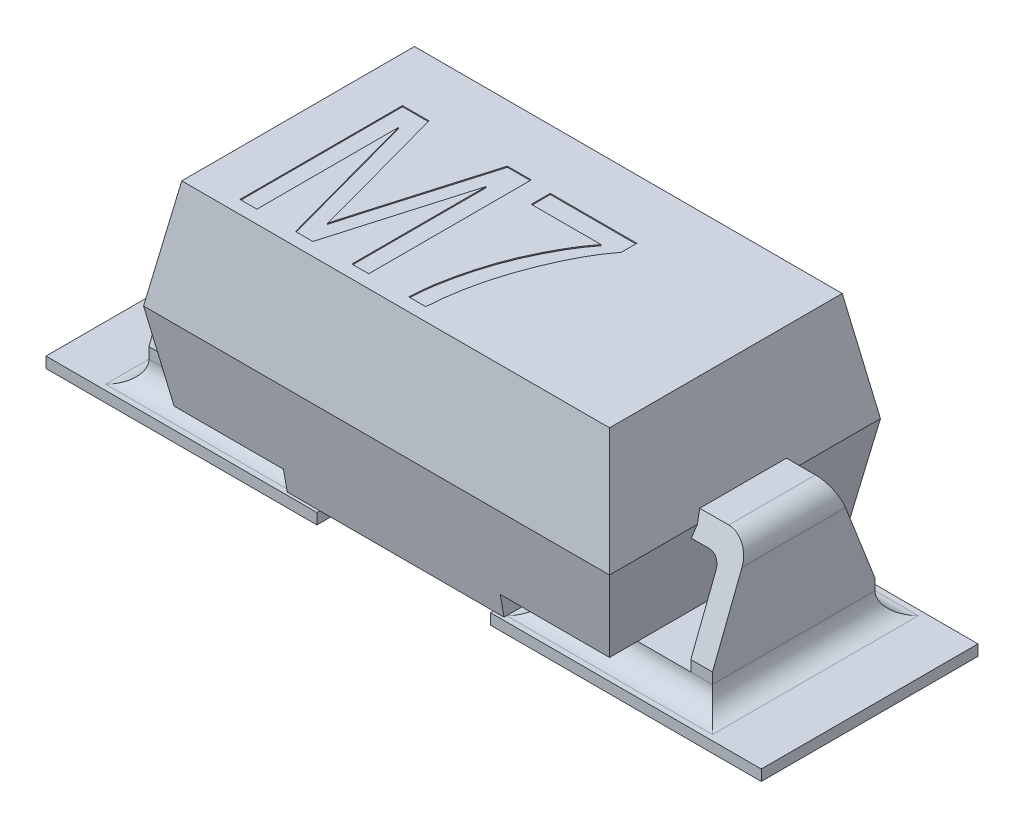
ISO-10303-21;
HEADER;
FILE_DESCRIPTION(('STEP AP214'),'2;1');
FILE_NAME('part.step','',(''),(''),'','','');
FILE_SCHEMA(('AUTOMOTIVE_DESIGN { 1 0 10303 214 1 1 1 1 }'));
ENDSEC;
DATA;
#1=APPLICATION_CONTEXT('core data for automotive mechanical design processes');
#2=APPLICATION_PROTOCOL_DEFINITION('international standard','automotive_design',2000,#1);
#3=PRODUCT_CONTEXT('',#1,'mechanical');
#4=PRODUCT('Part','Part','',(#3));
#5=PRODUCT_RELATED_PRODUCT_CATEGORY('part','',(#4));
#6=PRODUCT_DEFINITION_FORMATION('','',#4);
#7=PRODUCT_DEFINITION_CONTEXT('part definition',#1,'design');
#8=PRODUCT_DEFINITION('design','',#6,#7);
#9=PRODUCT_DEFINITION_SHAPE('','',#8);
#10=(LENGTH_UNIT() NAMED_UNIT(*) SI_UNIT(.MILLI.,.METRE.));
#11=(NAMED_UNIT(*) PLANE_ANGLE_UNIT() SI_UNIT($,.RADIAN.));
#12=(NAMED_UNIT(*) SI_UNIT($,.STERADIAN.) SOLID_ANGLE_UNIT());
#13=UNCERTAINTY_MEASURE_WITH_UNIT(LENGTH_MEASURE(1.E-05),#10,'distance_accuracy_value','');
#14=(GEOMETRIC_REPRESENTATION_CONTEXT(3) GLOBAL_UNCERTAINTY_ASSIGNED_CONTEXT((#13)) GLOBAL_UNIT_ASSIGNED_CONTEXT((#10,
#11,#12)) REPRESENTATION_CONTEXT('',''));
#15=CARTESIAN_POINT('',(0.,0.,0.));
#16=DIRECTION('',(0.,0.,1.));
#17=DIRECTION('',(1.,0.,0.));
#18=AXIS2_PLACEMENT_3D('',#15,#16,#17);
#19=CARTESIAN_POINT('',(0.,1.,0.));
#20=DIRECTION('',(0.,-1.,0.));
#21=DIRECTION('',(0.,0.,-1.));
#22=AXIS2_PLACEMENT_3D('',#19,#20,#21);
#23=PLANE('',#22);
#24=DIRECTION('',(-1.,0.,0.));
#25=VECTOR('',#24,1.);
#26=CARTESIAN_POINT('',(-1.40095978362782,1.,0.953461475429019));
#27=LINE('',#26,#25);
#28=CARTESIAN_POINT('',(-1.40095978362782,1.,0.953461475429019));
#29=VERTEX_POINT('',#28);
#30=CARTESIAN_POINT('',(-1.55680393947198,1.,0.953461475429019));
#31=VERTEX_POINT('',#30);
#32=EDGE_CURVE('E57',#29,#31,#27,.T.);
#33=ORIENTED_EDGE('',*,*,#32,.T.);
#34=DIRECTION('',(0.,0.,-1.));
#35=VECTOR('',#34,1.);
#36=CARTESIAN_POINT('',(-1.55680393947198,1.,0.953461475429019));
#37=LINE('',#36,#35);
#38=CARTESIAN_POINT('',(-1.55680393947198,1.,-0.546538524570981));
#39=VERTEX_POINT('',#38);
#40=EDGE_CURVE('E483',#31,#39,#37,.T.);
#41=ORIENTED_EDGE('',*,*,#40,.T.);
#42=DIRECTION('',(1.,0.,0.));
#43=VECTOR('',#42,1.);
#44=CARTESIAN_POINT('',(-1.55680393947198,1.,-0.546538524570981));
#45=LINE('',#44,#43);
#46=CARTESIAN_POINT('',(-1.3129930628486,1.,-0.546538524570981));
#47=VERTEX_POINT('',#46);
#48=EDGE_CURVE('E1144',#39,#47,#45,.T.);
#49=ORIENTED_EDGE('',*,*,#48,.T.);
#50=DIRECTION('',(0.26503443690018,0.,0.964238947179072));
#51=VECTOR('',#50,1.);
#52=CARTESIAN_POINT('',(-1.3129930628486,1.,-0.546538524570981));
#53=LINE('',#52,#51);
#54=CARTESIAN_POINT('',(-1.02108965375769,1.,0.515454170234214));
#55=VERTEX_POINT('',#54);
#56=EDGE_CURVE('E1141',#47,#55,#53,.T.);
#57=ORIENTED_EDGE('',*,*,#56,.T.);
#58=DIRECTION('',(0.254362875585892,0.,0.967108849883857));
#59=VECTOR('',#58,1.);
#60=CARTESIAN_POINT('',(-1.02108965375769,1.,0.515454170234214));
#61=LINE('',#60,#59);
#62=CARTESIAN_POINT('',(-0.962648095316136,1.,0.737653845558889));
#63=VERTEX_POINT('',#62);
#64=EDGE_CURVE('E1135',#55,#63,#61,.T.);
#65=ORIENTED_EDGE('',*,*,#64,.T.);
#66=CARTESIAN_POINT('',(-0.962648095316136,1.,0.737653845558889));
#67=CARTESIAN_POINT('',(-0.960741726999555,1.,0.730342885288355));
#68=CARTESIAN_POINT('',(-0.956735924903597,1.,0.714980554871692));
#69=CARTESIAN_POINT('',(-0.949939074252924,1.,0.690757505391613));
#70=CARTESIAN_POINT('',(-0.942269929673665,1.,0.664248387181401));
#71=CARTESIAN_POINT('',(-0.934535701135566,1.,0.63522528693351));
#72=CARTESIAN_POINT('',(-0.925605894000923,1.,0.60410420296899));
#73=CARTESIAN_POINT('',(-0.915817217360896,1.,0.570665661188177));
#74=CARTESIAN_POINT('',(-0.905484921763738,1.,0.53474337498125));
#75=CARTESIAN_POINT('',(-0.898418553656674,1.,0.50997660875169));
#76=CARTESIAN_POINT('',(-0.894770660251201,1.,0.497191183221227));
#77=B_SPLINE_CURVE_WITH_KNOTS('',3,(#66,#67,#68,#69,#70,#71,#72,#73,#74,#75,#76),.UNSPECIFIED.,
.F.,.F.,(4,1,1,1,1,1,1,1,4),(0.,0.0907120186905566,0.190610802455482,0.302053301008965,
0.422037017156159,0.551216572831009,0.690772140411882,0.840366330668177,1.),.UNSPECIFIED.);
#78=CARTESIAN_POINT('',(-0.894770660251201,1.,0.497191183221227));
#79=VERTEX_POINT('',#78);
#80=EDGE_CURVE('E1130',#63,#79,#77,.T.);
#81=ORIENTED_EDGE('',*,*,#80,.T.);
#82=DIRECTION('',(0.280999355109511,0.,-0.959707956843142));
#83=VECTOR('',#82,1.);
#84=CARTESIAN_POINT('',(-0.894770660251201,1.,0.497191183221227));
#85=LINE('',#84,#83);
#86=CARTESIAN_POINT('',(-0.589170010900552,1.,-0.546538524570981));
#87=VERTEX_POINT('',#86);
#88=EDGE_CURVE('E1127',#79,#87,#85,.T.);
#89=ORIENTED_EDGE('',*,*,#88,.T.);
#90=DIRECTION('',(1.,0.,0.));
#91=VECTOR('',#90,1.);
#92=CARTESIAN_POINT('',(-0.589170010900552,1.,-0.546538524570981));
#93=LINE('',#92,#91);
#94=CARTESIAN_POINT('',(-0.368492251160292,1.,-0.546538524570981));
#95=VERTEX_POINT('',#94);
#96=EDGE_CURVE('E1124',#87,#95,#93,.T.);
#97=ORIENTED_EDGE('',*,*,#96,.T.);
#98=DIRECTION('',(0.,0.,1.));
#99=VECTOR('',#98,1.);
#100=CARTESIAN_POINT('',(-0.368492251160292,1.,-0.546538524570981));
#101=LINE('',#100,#99);
#102=CARTESIAN_POINT('',(-0.368492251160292,1.,0.953461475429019));
#103=VERTEX_POINT('',#102);
#104=EDGE_CURVE('E1121',#95,#103,#101,.T.);
#105=ORIENTED_EDGE('',*,*,#104,.T.);
#106=DIRECTION('',(-1.,0.,0.));
#107=VECTOR('',#106,1.);
#108=CARTESIAN_POINT('',(-0.368492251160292,1.,0.953461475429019));
#109=LINE('',#108,#107);
#110=CARTESIAN_POINT('',(-0.524336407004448,1.,0.953461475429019));
#111=VERTEX_POINT('',#110);
#112=EDGE_CURVE('E1118',#103,#111,#109,.T.);
#113=ORIENTED_EDGE('',*,*,#112,.T.);
#114=DIRECTION('',(0.,0.,-1.));
#115=VECTOR('',#114,1.);
#116=CARTESIAN_POINT('',(-0.524336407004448,1.,0.953461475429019));
#117=LINE('',#116,#115);
#118=CARTESIAN_POINT('',(-0.524336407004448,1.,-0.2847690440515));
#119=VERTEX_POINT('',#118);
#120=EDGE_CURVE('E1115',#111,#119,#117,.T.);
#121=ORIENTED_EDGE('',*,*,#120,.T.);
#122=DIRECTION('',(-0.279238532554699,0.,0.960221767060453));
#123=VECTOR('',#122,1.);
#124=CARTESIAN_POINT('',(-0.524336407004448,1.,-0.2847690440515));
#125=LINE('',#124,#123);
#126=CARTESIAN_POINT('',(-0.884421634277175,1.,0.953461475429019));
#127=VERTEX_POINT('',#126);
#128=EDGE_CURVE('E1112',#119,#127,#125,.T.);
#129=ORIENTED_EDGE('',*,*,#128,.T.);
#130=DIRECTION('',(-1.,0.,0.));
#131=VECTOR('',#130,1.);
#132=CARTESIAN_POINT('',(-0.884421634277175,1.,0.953461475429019));
#133=LINE('',#132,#131);
#134=CARTESIAN_POINT('',(-1.04391838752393,1.,0.953461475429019));
#135=VERTEX_POINT('',#134);
#136=EDGE_CURVE('E1109',#127,#135,#133,.T.);
#137=ORIENTED_EDGE('',*,*,#136,.T.);
#138=DIRECTION('',(-0.263117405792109,0.,-0.964763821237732));
#139=VECTOR('',#138,1.);
#140=CARTESIAN_POINT('',(-1.04391838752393,1.,0.953461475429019));
#141=LINE('',#140,#139);
#142=CARTESIAN_POINT('',(-1.40095978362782,1.,-0.355690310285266));
#143=VERTEX_POINT('',#142);
#144=EDGE_CURVE('E1106',#135,#143,#141,.T.);
#145=ORIENTED_EDGE('',*,*,#144,.T.);
#146=DIRECTION('',(0.,0.,1.));
#147=VECTOR('',#146,1.);
#148=CARTESIAN_POINT('',(-1.40095978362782,1.,-0.355690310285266));
#149=LINE('',#148,#147);
#150=EDGE_CURVE('E493',#143,#29,#149,.T.);
#151=ORIENTED_EDGE('',*,*,#150,.T.);
#152=EDGE_LOOP('',(#33,#41,#49,#57,#65,#81,#89,#97,#105,#113,#121,#129,#137,#145,#151));
#153=FACE_BOUND('',#152,.T.);
#154=DIRECTION('',(0.,0.,1.));
#155=VECTOR('',#154,1.);
#156=CARTESIAN_POINT('',(1.97367301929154,1.,-1.25));
#157=LINE('',#156,#155);
#158=CARTESIAN_POINT('',(1.97367301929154,1.,-1.07367301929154));
#159=VERTEX_POINT('',#158);
#160=CARTESIAN_POINT('',(1.97367301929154,1.,1.07367301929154));
#161=VERTEX_POINT('',#160);
#162=EDGE_CURVE('E1979',#159,#161,#157,.T.);
#163=ORIENTED_EDGE('',*,*,#162,.F.);
#164=DIRECTION('',(1.,0.,0.));
#165=VECTOR('',#164,1.);
#166=CARTESIAN_POINT('',(-2.15,1.,-1.07367301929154));
#167=LINE('',#166,#165);
#168=CARTESIAN_POINT('',(-1.97367301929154,1.,-1.07367301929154));
#169=VERTEX_POINT('',#168);
#170=EDGE_CURVE('E1969',#169,#159,#167,.T.);
#171=ORIENTED_EDGE('',*,*,#170,.F.);
#172=DIRECTION('',(0.,0.,1.));
#173=VECTOR('',#172,1.);
#174=CARTESIAN_POINT('',(-1.97367301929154,1.,-1.25));
#175=LINE('',#174,#173);
#176=CARTESIAN_POINT('',(-1.97367301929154,1.,1.07367301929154));
#177=VERTEX_POINT('',#176);
#178=EDGE_CURVE('E1985',#169,#177,#175,.T.);
#179=ORIENTED_EDGE('',*,*,#178,.T.);
#180=DIRECTION('',(1.,0.,0.));
#181=VECTOR('',#180,1.);
#182=CARTESIAN_POINT('',(-2.15,1.,1.07367301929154));
#183=LINE('',#182,#181);
#184=EDGE_CURVE('E1971',#177,#161,#183,.T.);
#185=ORIENTED_EDGE('',*,*,#184,.T.);
#186=EDGE_LOOP('',(#163,#171,#179,#185));
#187=FACE_BOUND('',#186,.T.);
#188=DIRECTION('',(-1.,0.,0.));
#189=VECTOR('',#188,1.);
#190=CARTESIAN_POINT('',(0.469170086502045,1.,-0.351733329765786));
#191=LINE('',#190,#189);
#192=CARTESIAN_POINT('',(0.469170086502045,1.,-0.351733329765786));
#193=VERTEX_POINT('',#192);
#194=CARTESIAN_POINT('',(-0.173687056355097,1.,-0.351733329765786));
#195=VERTEX_POINT('',#194);
#196=EDGE_CURVE('E49',#193,#195,#191,.T.);
#197=ORIENTED_EDGE('',*,*,#196,.T.);
#198=DIRECTION('',(0.,0.,-1.));
#199=VECTOR('',#198,1.);
#200=CARTESIAN_POINT('',(-0.173687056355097,1.,-0.351733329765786));
#201=LINE('',#200,#199);
#202=CARTESIAN_POINT('',(-0.173687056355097,1.,-0.527058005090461));
#203=VERTEX_POINT('',#202);
#204=EDGE_CURVE('E480',#195,#203,#201,.T.);
#205=ORIENTED_EDGE('',*,*,#204,.T.);
#206=DIRECTION('',(1.,0.,0.));
#207=VECTOR('',#206,1.);
#208=CARTESIAN_POINT('',(-0.173687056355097,1.,-0.527058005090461));
#209=LINE('',#208,#207);
#210=CARTESIAN_POINT('',(0.625014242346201,1.,-0.527058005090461));
#211=VERTEX_POINT('',#210);
#212=EDGE_CURVE('E1807',#203,#211,#209,.T.);
#213=ORIENTED_EDGE('',*,*,#212,.T.);
#214=DIRECTION('',(0.,0.,1.));
#215=VECTOR('',#214,1.);
#216=CARTESIAN_POINT('',(0.625014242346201,1.,-0.527058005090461));
#217=LINE('',#216,#215);
#218=CARTESIAN_POINT('',(0.625014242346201,1.,-0.383693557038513));
#219=VERTEX_POINT('',#218);
#220=EDGE_CURVE('E1810',#211,#219,#217,.T.);
#221=ORIENTED_EDGE('',*,*,#220,.T.);
#222=CARTESIAN_POINT('',(0.625014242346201,1.,-0.383693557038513));
#223=CARTESIAN_POINT('',(0.610195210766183,1.,-0.363853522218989));
#224=CARTESIAN_POINT('',(0.580031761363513,1.,-0.323470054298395));
#225=CARTESIAN_POINT('',(0.537849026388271,1.,-0.258872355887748));
#226=CARTESIAN_POINT('',(0.496824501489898,1.,-0.190074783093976));
#227=CARTESIAN_POINT('',(0.456919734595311,1.,-0.117019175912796));
#228=CARTESIAN_POINT('',(0.418603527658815,1.,-0.0394707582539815));
#229=CARTESIAN_POINT('',(0.381489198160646,1.,0.0423272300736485));
#230=CARTESIAN_POINT('',(0.345923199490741,1.,0.128682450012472));
#231=CARTESIAN_POINT('',(0.311883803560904,1.,0.218497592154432));
#232=CARTESIAN_POINT('',(0.279986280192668,1.,0.310359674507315));
#233=CARTESIAN_POINT('',(0.251733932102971,1.,0.40287279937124));
#234=CARTESIAN_POINT('',(0.226994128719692,1.,0.495143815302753));
#235=CARTESIAN_POINT('',(0.206072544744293,1.,0.587168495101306));
#236=CARTESIAN_POINT('',(0.188242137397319,1.,0.678899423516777));
#237=CARTESIAN_POINT('',(0.174307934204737,1.,0.770496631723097));
#238=CARTESIAN_POINT('',(0.163800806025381,1.,0.861981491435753));
#239=CARTESIAN_POINT('',(0.159585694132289,1.,0.92300324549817));
#240=CARTESIAN_POINT('',(0.157481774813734,1.,0.953461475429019));
#241=B_SPLINE_CURVE_WITH_KNOTS('',3,(#222,#223,#224,#225,#226,#227,#228,#229,#230,#231,#232,
#233,#234,#235,#236,#237,#238,#239,#240),.UNSPECIFIED.,.F.,.F.,(4,1,1,1,1,1,1,1,1,1,1,1,1,1,1,1,
4),(0.,0.0517647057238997,0.105364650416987,0.161209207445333,0.219211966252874,
0.279359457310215,0.342018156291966,0.406980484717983,0.474588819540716,0.542816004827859,
0.610255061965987,0.676788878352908,0.742504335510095,0.807531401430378,0.872125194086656,
0.936172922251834,1.),.UNSPECIFIED.);
#242=CARTESIAN_POINT('',(0.157481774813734,1.,0.953461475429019));
#243=VERTEX_POINT('',#242);
#244=EDGE_CURVE('E1813',#219,#243,#241,.T.);
#245=ORIENTED_EDGE('',*,*,#244,.T.);
#246=DIRECTION('',(-1.,0.,0.));
#247=VECTOR('',#246,1.);
#248=CARTESIAN_POINT('',(0.157481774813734,1.,0.953461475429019));
#249=LINE('',#248,#247);
#250=CARTESIAN_POINT('',(0.00163761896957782,1.,0.953461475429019));
#251=VERTEX_POINT('',#250);
#252=EDGE_CURVE('E1818',#243,#251,#249,.T.);
#253=ORIENTED_EDGE('',*,*,#252,.T.);
#254=CARTESIAN_POINT('',(0.00163761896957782,1.,0.953461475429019));
#255=CARTESIAN_POINT('',(0.00211913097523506,1.,0.937423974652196));
#256=CARTESIAN_POINT('',(0.00310141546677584,1.,0.904707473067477));
#257=CARTESIAN_POINT('',(0.00704218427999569,1.,0.85468831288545));
#258=CARTESIAN_POINT('',(0.0120098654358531,1.,0.802575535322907));
#259=CARTESIAN_POINT('',(0.0194543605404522,1.,0.748599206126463));
#260=CARTESIAN_POINT('',(0.0286049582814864,1.,0.692678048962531));
#261=CARTESIAN_POINT('',(0.0397251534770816,1.,0.634882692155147));
#262=CARTESIAN_POINT('',(0.0519936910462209,1.,0.574917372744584));
#263=CARTESIAN_POINT('',(0.0716389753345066,1.,0.492743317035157));
#264=CARTESIAN_POINT('',(0.0993282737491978,1.,0.389813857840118));
#265=CARTESIAN_POINT('',(0.139120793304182,1.,0.268612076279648));
#266=CARTESIAN_POINT('',(0.183980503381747,1.,0.150180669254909));
#267=CARTESIAN_POINT('',(0.235035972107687,1.,0.0360370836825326));
#268=CARTESIAN_POINT('',(0.289479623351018,1.,-0.0727081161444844));
#269=CARTESIAN_POINT('',(0.346814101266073,1.,-0.173790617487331));
#270=CARTESIAN_POINT('',(0.405374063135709,1.,-0.267035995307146));
#271=CARTESIAN_POINT('',(0.448283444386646,1.,-0.324003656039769));
#272=CARTESIAN_POINT('',(0.469170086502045,1.,-0.351733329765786));
#273=B_SPLINE_CURVE_WITH_KNOTS('',3,(#254,#255,#256,#257,#258,#259,#260,#261,#262,#263,#264,
#265,#266,#267,#268,#269,#270,#271,#272),.UNSPECIFIED.,.F.,.F.,(4,1,1,1,1,1,1,1,1,1,1,1,1,1,1,1,
4),(0.,0.0342221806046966,0.0698132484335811,0.107006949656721,0.145881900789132,
0.186019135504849,0.227874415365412,0.271426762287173,0.316575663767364,0.408092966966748,
0.498714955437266,0.58859571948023,0.678126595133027,0.765339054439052,0.847918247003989,
0.925972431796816,1.),.UNSPECIFIED.);
#274=EDGE_CURVE('E476',#251,#193,#273,.T.);
#275=ORIENTED_EDGE('',*,*,#274,.T.);
#276=EDGE_LOOP('',(#197,#205,#213,#221,#245,#253,#275));
#277=FACE_BOUND('',#276,.T.);
#278=ADVANCED_FACE('F32',(#153,#187,#277),#23,.F.);
#279=CARTESIAN_POINT('',(2.15,0.,-1.25));
#280=DIRECTION('',(-0.984807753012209,0.173648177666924,0.));
#281=DIRECTION('',(-0.173648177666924,-0.984807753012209,0.));
#282=AXIS2_PLACEMENT_3D('',#279,#280,#281);
#283=PLANE('',#282);
#284=DIRECTION('',(0.16216241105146,0.919668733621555,0.357648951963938));
#285=VECTOR('',#284,1.);
#286=CARTESIAN_POINT('',(2.10295781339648,-0.266789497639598,-0.542640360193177));
#287=LINE('',#286,#285);
#288=CARTESIAN_POINT('',(2.13236730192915,-0.1,-0.477777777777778));
#289=VERTEX_POINT('',#288);
#290=CARTESIAN_POINT('',(2.15,0.,-0.438888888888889));
#291=VERTEX_POINT('',#290);
#292=EDGE_CURVE('E1909',#289,#291,#287,.T.);
#293=ORIENTED_EDGE('',*,*,#292,.F.);
#294=DIRECTION('',(0.,0.,-1.));
#295=VECTOR('',#294,1.);
#296=CARTESIAN_POINT('',(2.13236730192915,-0.1,-1.25));
#297=LINE('',#296,#295);
#298=CARTESIAN_POINT('',(2.13236730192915,-0.1,0.477777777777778));
#299=VERTEX_POINT('',#298);
#300=EDGE_CURVE('E1902',#299,#289,#297,.T.);
#301=ORIENTED_EDGE('',*,*,#300,.F.);
#302=DIRECTION('',(-0.16216241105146,-0.919668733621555,0.357648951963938));
#303=VECTOR('',#302,1.);
#304=CARTESIAN_POINT('',(2.24795085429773,0.55550689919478,0.222858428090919));
#305=LINE('',#304,#303);
#306=CARTESIAN_POINT('',(2.15,0.,0.438888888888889));
#307=VERTEX_POINT('',#306);
#308=EDGE_CURVE('E1897',#307,#299,#305,.T.);
#309=ORIENTED_EDGE('',*,*,#308,.F.);
#310=DIRECTION('',(0.,0.,1.));
#311=VECTOR('',#310,1.);
#312=CARTESIAN_POINT('',(2.15,0.,-1.25));
#313=LINE('',#312,#311);
#314=CARTESIAN_POINT('',(2.15,0.,1.25));
#315=VERTEX_POINT('',#314);
#316=EDGE_CURVE('E1976',#307,#315,#313,.T.);
#317=ORIENTED_EDGE('',*,*,#316,.T.);
#318=DIRECTION('',(0.171087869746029,0.970287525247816,0.171087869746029));
#319=VECTOR('',#318,1.);
#320=CARTESIAN_POINT('',(2.07682235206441,-0.415011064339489,1.17682235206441));
#321=LINE('',#320,#319);
#322=CARTESIAN_POINT('',(2.00893841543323,-0.8,1.10893841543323));
#323=VERTEX_POINT('',#322);
#324=EDGE_CURVE('E1949',#323,#315,#321,.T.);
#325=ORIENTED_EDGE('',*,*,#324,.F.);
#326=DIRECTION('',(0.,0.,1.));
#327=VECTOR('',#326,1.);
#328=CARTESIAN_POINT('',(2.00893841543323,-0.8,-1.25));
#329=LINE('',#328,#327);
#330=CARTESIAN_POINT('',(2.00893841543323,-0.8,-1.10893841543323));
#331=VERTEX_POINT('',#330);
#332=EDGE_CURVE('E1924',#331,#323,#329,.T.);
#333=ORIENTED_EDGE('',*,*,#332,.F.);
#334=DIRECTION('',(-0.171087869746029,-0.970287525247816,0.171087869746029));
#335=VECTOR('',#334,1.);
#336=CARTESIAN_POINT('',(2.15,0.,-1.25));
#337=LINE('',#336,#335);
#338=CARTESIAN_POINT('',(2.15,0.,-1.25));
#339=VERTEX_POINT('',#338);
#340=EDGE_CURVE('E1946',#339,#331,#337,.T.);
#341=ORIENTED_EDGE('',*,*,#340,.F.);
#342=EDGE_CURVE('E1982',#339,#291,#313,.T.);
#343=ORIENTED_EDGE('',*,*,#342,.T.);
#344=EDGE_LOOP('',(#293,#301,#309,#317,#325,#333,#341,#343));
#345=FACE_BOUND('',#344,.T.);
#346=ADVANCED_FACE('F684',(#345),#283,.F.);
#347=CARTESIAN_POINT('',(1.97367301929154,1.,-1.25));
#348=DIRECTION('',(-0.984807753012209,-0.173648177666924,0.));
#349=DIRECTION('',(0.173648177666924,-0.984807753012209,0.));
#350=AXIS2_PLACEMENT_3D('',#347,#348,#349);
#351=PLANE('',#350);
#352=DIRECTION('',(-0.16216241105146,0.919668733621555,0.357648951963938));
#353=VECTOR('',#352,1.);
#354=CARTESIAN_POINT('',(2.04326967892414,0.605297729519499,-0.203495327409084));
#355=LINE('',#354,#353);
#356=CARTESIAN_POINT('',(2.13236730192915,0.0999999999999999,-0.4));
#357=VERTEX_POINT('',#356);
#358=EDGE_CURVE('E1906',#291,#357,#355,.T.);
#359=ORIENTED_EDGE('',*,*,#358,.F.);
#360=ORIENTED_EDGE('',*,*,#342,.F.);
#361=DIRECTION('',(0.171087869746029,-0.970287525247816,-0.171087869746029));
#362=VECTOR('',#361,1.);
#363=CARTESIAN_POINT('',(1.97883429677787,0.970728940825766,-1.07883429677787));
#364=LINE('',#363,#362);
#365=EDGE_CURVE('E1962',#159,#339,#364,.T.);
#366=ORIENTED_EDGE('',*,*,#365,.F.);
#367=ORIENTED_EDGE('',*,*,#162,.T.);
#368=DIRECTION('',(-0.171087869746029,0.970287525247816,-0.171087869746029));
#369=VECTOR('',#368,1.);
#370=CARTESIAN_POINT('',(1.90565664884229,1.38574000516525,1.00565664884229));
#371=LINE('',#370,#369);
#372=EDGE_CURVE('E1965',#315,#161,#371,.T.);
#373=ORIENTED_EDGE('',*,*,#372,.F.);
#374=ORIENTED_EDGE('',*,*,#316,.F.);
#375=DIRECTION('',(0.16216241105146,-0.919668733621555,0.357648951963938));
#376=VECTOR('',#375,1.);
#377=CARTESIAN_POINT('',(1.89827663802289,1.42759412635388,-0.116286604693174));
#378=LINE('',#377,#376);
#379=CARTESIAN_POINT('',(2.13236730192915,0.1,0.4));
#380=VERTEX_POINT('',#379);
#381=EDGE_CURVE('E1895',#380,#307,#378,.T.);
#382=ORIENTED_EDGE('',*,*,#381,.F.);
#383=DIRECTION('',(0.,0.,1.));
#384=VECTOR('',#383,1.);
#385=CARTESIAN_POINT('',(2.13236730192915,0.0999999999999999,-1.25));
#386=LINE('',#385,#384);
#387=EDGE_CURVE('E902',#357,#380,#386,.T.);
#388=ORIENTED_EDGE('',*,*,#387,.F.);
#389=EDGE_LOOP('',(#359,#360,#366,#367,#373,#374,#382,#388));
#390=FACE_BOUND('',#389,.T.);
#391=ADVANCED_FACE('F687',(#390),#351,.F.);
#392=CARTESIAN_POINT('',(-2.15,0.,-1.25));
#393=DIRECTION('',(0.984807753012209,-0.173648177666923,0.));
#394=DIRECTION('',(0.173648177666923,0.984807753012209,0.));
#395=AXIS2_PLACEMENT_3D('',#392,#393,#394);
#396=PLANE('',#395);
#397=DIRECTION('',(-0.16216241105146,-0.919668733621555,-0.357648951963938));
#398=VECTOR('',#397,1.);
#399=CARTESIAN_POINT('',(-2.19704218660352,-0.266789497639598,-0.542640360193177));
#400=LINE('',#399,#398);
#401=CARTESIAN_POINT('',(-2.13236730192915,0.0999999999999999,-0.4));
#402=VERTEX_POINT('',#401);
#403=CARTESIAN_POINT('',(-2.15,0.,-0.438888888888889));
#404=VERTEX_POINT('',#403);
#405=EDGE_CURVE('E1894',#402,#404,#400,.T.);
#406=ORIENTED_EDGE('',*,*,#405,.F.);
#407=DIRECTION('',(0.,0.,-1.));
#408=VECTOR('',#407,1.);
#409=CARTESIAN_POINT('',(-2.13236730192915,0.0999999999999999,-1.25));
#410=LINE('',#409,#408);
#411=CARTESIAN_POINT('',(-2.13236730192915,0.0999999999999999,0.4));
#412=VERTEX_POINT('',#411);
#413=EDGE_CURVE('E877',#412,#402,#410,.T.);
#414=ORIENTED_EDGE('',*,*,#413,.F.);
#415=DIRECTION('',(0.16216241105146,0.919668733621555,-0.357648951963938));
#416=VECTOR('',#415,1.);
#417=CARTESIAN_POINT('',(-2.05204914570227,0.55550689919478,0.222858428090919));
#418=LINE('',#417,#416);
#419=CARTESIAN_POINT('',(-2.15,0.,0.438888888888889));
#420=VERTEX_POINT('',#419);
#421=EDGE_CURVE('E1868',#420,#412,#418,.T.);
#422=ORIENTED_EDGE('',*,*,#421,.F.);
#423=DIRECTION('',(0.,0.,1.));
#424=VECTOR('',#423,1.);
#425=CARTESIAN_POINT('',(-2.15,0.,-1.25));
#426=LINE('',#425,#424);
#427=CARTESIAN_POINT('',(-2.15,0.,1.25));
#428=VERTEX_POINT('',#427);
#429=EDGE_CURVE('E1981',#420,#428,#426,.T.);
#430=ORIENTED_EDGE('',*,*,#429,.T.);
#431=DIRECTION('',(0.171087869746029,0.970287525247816,-0.171087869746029));
#432=VECTOR('',#431,1.);
#433=CARTESIAN_POINT('',(-2.07682235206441,0.415011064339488,1.17682235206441));
#434=LINE('',#433,#432);
#435=EDGE_CURVE('E1987',#428,#177,#434,.T.);
#436=ORIENTED_EDGE('',*,*,#435,.T.);
#437=ORIENTED_EDGE('',*,*,#178,.F.);
#438=DIRECTION('',(-0.171087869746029,-0.970287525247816,-0.171087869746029));
#439=VECTOR('',#438,1.);
#440=CARTESIAN_POINT('',(-2.15,0.,-1.25));
#441=LINE('',#440,#439);
#442=CARTESIAN_POINT('',(-2.15,0.,-1.25));
#443=VERTEX_POINT('',#442);
#444=EDGE_CURVE('E1992',#169,#443,#441,.T.);
#445=ORIENTED_EDGE('',*,*,#444,.T.);
#446=EDGE_CURVE('E1988',#443,#404,#426,.T.);
#447=ORIENTED_EDGE('',*,*,#446,.T.);
#448=EDGE_LOOP('',(#406,#414,#422,#430,#436,#437,#445,#447));
#449=FACE_BOUND('',#448,.T.);
#450=ADVANCED_FACE('F691',(#449),#396,.F.);
#451=CARTESIAN_POINT('',(-1.97367301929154,-1.,-1.25));
#452=DIRECTION('',(0.984807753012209,0.173648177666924,0.));
#453=DIRECTION('',(-0.173648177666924,0.984807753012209,0.));
#454=AXIS2_PLACEMENT_3D('',#451,#452,#453);
#455=PLANE('',#454);
#456=DIRECTION('',(0.16216241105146,-0.919668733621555,-0.357648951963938));
#457=VECTOR('',#456,1.);
#458=CARTESIAN_POINT('',(-1.94918530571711,-1.1388767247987,-0.88178539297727));
#459=LINE('',#458,#457);
#460=CARTESIAN_POINT('',(-2.13236730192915,-0.1,-0.477777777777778));
#461=VERTEX_POINT('',#460);
#462=EDGE_CURVE('E1878',#404,#461,#459,.T.);
#463=ORIENTED_EDGE('',*,*,#462,.F.);
#464=ORIENTED_EDGE('',*,*,#446,.F.);
#465=DIRECTION('',(0.171087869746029,-0.970287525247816,0.171087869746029));
#466=VECTOR('',#465,1.);
#467=CARTESIAN_POINT('',(-1.97883429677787,-0.970728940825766,-1.07883429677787));
#468=LINE('',#467,#466);
#469=CARTESIAN_POINT('',(-2.00893841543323,-0.8,-1.10893841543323));
#470=VERTEX_POINT('',#469);
#471=EDGE_CURVE('E1954',#443,#470,#468,.T.);
#472=ORIENTED_EDGE('',*,*,#471,.T.);
#473=DIRECTION('',(0.,0.,1.));
#474=VECTOR('',#473,1.);
#475=CARTESIAN_POINT('',(-2.00893841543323,-0.8,-1.25));
#476=LINE('',#475,#474);
#477=CARTESIAN_POINT('',(-2.00893841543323,-0.8,1.10893841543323));
#478=VERTEX_POINT('',#477);
#479=EDGE_CURVE('E1940',#470,#478,#476,.T.);
#480=ORIENTED_EDGE('',*,*,#479,.T.);
#481=DIRECTION('',(-0.171087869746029,0.970287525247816,0.171087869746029));
#482=VECTOR('',#481,1.);
#483=CARTESIAN_POINT('',(-1.90565664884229,-1.38574000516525,1.00565664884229));
#484=LINE('',#483,#482);
#485=EDGE_CURVE('E1959',#478,#428,#484,.T.);
#486=ORIENTED_EDGE('',*,*,#485,.T.);
#487=ORIENTED_EDGE('',*,*,#429,.F.);
#488=DIRECTION('',(-0.16216241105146,0.919668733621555,-0.357648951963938));
#489=VECTOR('',#488,1.);
#490=CARTESIAN_POINT('',(-2.09417834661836,-0.316580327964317,0.562003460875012));
#491=LINE('',#490,#489);
#492=CARTESIAN_POINT('',(-2.13236730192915,-0.1,0.477777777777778));
#493=VERTEX_POINT('',#492);
#494=EDGE_CURVE('E1881',#493,#420,#491,.T.);
#495=ORIENTED_EDGE('',*,*,#494,.F.);
#496=DIRECTION('',(0.,0.,1.));
#497=VECTOR('',#496,1.);
#498=CARTESIAN_POINT('',(-2.13236730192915,-0.1,-1.25));
#499=LINE('',#498,#497);
#500=EDGE_CURVE('E1865',#461,#493,#499,.T.);
#501=ORIENTED_EDGE('',*,*,#500,.F.);
#502=EDGE_LOOP('',(#463,#464,#472,#480,#486,#487,#495,#501));
#503=FACE_BOUND('',#502,.T.);
#504=ADVANCED_FACE('F675',(#503),#455,.F.);
#505=CARTESIAN_POINT('',(-2.15,-1.,1.07367301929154));
#506=DIRECTION('',(0.,0.173648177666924,-0.984807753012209));
#507=DIRECTION('',(0.,0.984807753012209,0.173648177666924));
#508=AXIS2_PLACEMENT_3D('',#505,#506,#507);
#509=PLANE('',#508);
#510=DIRECTION('',(-1.,0.,0.));
#511=VECTOR('',#510,1.);
#512=CARTESIAN_POINT('',(-2.15,-0.8,1.10893841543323));
#513=LINE('',#512,#511);
#514=CARTESIAN_POINT('',(0.999999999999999,-0.8,1.10893841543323));
#515=VERTEX_POINT('',#514);
#516=EDGE_CURVE('E1926',#323,#515,#513,.T.);
#517=ORIENTED_EDGE('',*,*,#516,.F.);
#518=ORIENTED_EDGE('',*,*,#324,.T.);
#519=DIRECTION('',(1.,0.,0.));
#520=VECTOR('',#519,1.);
#521=CARTESIAN_POINT('',(-2.15,0.,1.25));
#522=LINE('',#521,#520);
#523=EDGE_CURVE('E1973',#428,#315,#522,.T.);
#524=ORIENTED_EDGE('',*,*,#523,.F.);
#525=ORIENTED_EDGE('',*,*,#485,.F.);
#526=DIRECTION('',(1.,0.,0.));
#527=VECTOR('',#526,1.);
#528=CARTESIAN_POINT('',(-2.15,-0.8,1.10893841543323));
#529=LINE('',#528,#527);
#530=CARTESIAN_POINT('',(-1.,-0.8,1.10893841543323));
#531=VERTEX_POINT('',#530);
#532=EDGE_CURVE('E1943',#478,#531,#529,.T.);
#533=ORIENTED_EDGE('',*,*,#532,.T.);
#534=DIRECTION('',(0.,0.984807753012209,0.173648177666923));
#535=VECTOR('',#534,1.);
#536=CARTESIAN_POINT('',(-1.,-0.8,1.10893841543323));
#537=LINE('',#536,#535);
#538=CARTESIAN_POINT('',(-1.,-1.,1.07367301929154));
#539=VERTEX_POINT('',#538);
#540=EDGE_CURVE('E1934',#539,#531,#537,.T.);
#541=ORIENTED_EDGE('',*,*,#540,.F.);
#542=DIRECTION('',(1.,0.,0.));
#543=VECTOR('',#542,1.);
#544=CARTESIAN_POINT('',(-2.15,-1.,1.07367301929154));
#545=LINE('',#544,#543);
#546=CARTESIAN_POINT('',(1.,-1.,1.07367301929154));
#547=VERTEX_POINT('',#546);
#548=EDGE_CURVE('E1957',#539,#547,#545,.T.);
#549=ORIENTED_EDGE('',*,*,#548,.T.);
#550=DIRECTION('',(0.,0.984807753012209,0.173648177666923));
#551=VECTOR('',#550,1.);
#552=CARTESIAN_POINT('',(1.,-0.8,1.10893841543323));
#553=LINE('',#552,#551);
#554=EDGE_CURVE('E1919',#547,#515,#553,.T.);
#555=ORIENTED_EDGE('',*,*,#554,.T.);
#556=EDGE_LOOP('',(#517,#518,#524,#525,#533,#541,#549,#555));
#557=FACE_BOUND('',#556,.T.);
#558=ADVANCED_FACE('F671',(#557),#509,.F.);
#559=CARTESIAN_POINT('',(-2.15,-1.,-1.07367301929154));
#560=DIRECTION('',(0.,0.173648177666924,0.984807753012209));
#561=DIRECTION('',(0.,-0.984807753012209,0.173648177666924));
#562=AXIS2_PLACEMENT_3D('',#559,#560,#561);
#563=PLANE('',#562);
#564=DIRECTION('',(1.,0.,0.));
#565=VECTOR('',#564,1.);
#566=CARTESIAN_POINT('',(-2.15,-0.8,-1.10893841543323));
#567=LINE('',#566,#565);
#568=CARTESIAN_POINT('',(0.999999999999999,-0.8,-1.10893841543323));
#569=VERTEX_POINT('',#568);
#570=EDGE_CURVE('E1884',#569,#331,#567,.T.);
#571=ORIENTED_EDGE('',*,*,#570,.F.);
#572=DIRECTION('',(0.,-0.984807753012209,0.173648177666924));
#573=VECTOR('',#572,1.);
#574=CARTESIAN_POINT('',(1.,-1.,-1.07367301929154));
#575=LINE('',#574,#573);
#576=CARTESIAN_POINT('',(1.,-1.,-1.07367301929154));
#577=VERTEX_POINT('',#576);
#578=EDGE_CURVE('E1913',#569,#577,#575,.T.);
#579=ORIENTED_EDGE('',*,*,#578,.T.);
#580=DIRECTION('',(1.,0.,0.));
#581=VECTOR('',#580,1.);
#582=CARTESIAN_POINT('',(-2.15,-1.,-1.07367301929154));
#583=LINE('',#582,#581);
#584=CARTESIAN_POINT('',(-1.,-1.,-1.07367301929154));
#585=VERTEX_POINT('',#584);
#586=EDGE_CURVE('E1952',#585,#577,#583,.T.);
#587=ORIENTED_EDGE('',*,*,#586,.F.);
#588=DIRECTION('',(0.,-0.984807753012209,0.173648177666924));
#589=VECTOR('',#588,1.);
#590=CARTESIAN_POINT('',(-1.,-1.,-1.07367301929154));
#591=LINE('',#590,#589);
#592=CARTESIAN_POINT('',(-1.,-0.8,-1.10893841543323));
#593=VERTEX_POINT('',#592);
#594=EDGE_CURVE('E1928',#593,#585,#591,.T.);
#595=ORIENTED_EDGE('',*,*,#594,.F.);
#596=DIRECTION('',(-1.,0.,0.));
#597=VECTOR('',#596,1.);
#598=CARTESIAN_POINT('',(-2.15,-0.8,-1.10893841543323));
#599=LINE('',#598,#597);
#600=EDGE_CURVE('E1995',#593,#470,#599,.T.);
#601=ORIENTED_EDGE('',*,*,#600,.T.);
#602=ORIENTED_EDGE('',*,*,#471,.F.);
#603=DIRECTION('',(1.,0.,0.));
#604=VECTOR('',#603,1.);
#605=CARTESIAN_POINT('',(-2.15,0.,-1.25));
#606=LINE('',#605,#604);
#607=EDGE_CURVE('E1968',#443,#339,#606,.T.);
#608=ORIENTED_EDGE('',*,*,#607,.T.);
#609=ORIENTED_EDGE('',*,*,#340,.T.);
#610=EDGE_LOOP('',(#571,#579,#587,#595,#601,#602,#608,#609));
#611=FACE_BOUND('',#610,.T.);
#612=ADVANCED_FACE('F667',(#611),#563,.F.);
#613=CARTESIAN_POINT('',(-2.15,-0.8,1.25));
#614=DIRECTION('',(0.,1.,0.));
#615=DIRECTION('',(0.,0.,1.));
#616=AXIS2_PLACEMENT_3D('',#613,#614,#615);
#617=PLANE('',#616);
#618=DIRECTION('',(0.,0.,-1.));
#619=VECTOR('',#618,1.);
#620=CARTESIAN_POINT('',(-1.,-0.8,-1.10893841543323));
#621=LINE('',#620,#619);
#622=EDGE_CURVE('E1937',#531,#593,#621,.T.);
#623=ORIENTED_EDGE('',*,*,#622,.F.);
#624=ORIENTED_EDGE('',*,*,#532,.F.);
#625=ORIENTED_EDGE('',*,*,#479,.F.);
#626=ORIENTED_EDGE('',*,*,#600,.F.);
#627=EDGE_LOOP('',(#623,#624,#625,#626));
#628=FACE_BOUND('',#627,.T.);
#629=ADVANCED_FACE('F663',(#628),#617,.F.);
#630=CARTESIAN_POINT('',(0.,-1.,0.));
#631=DIRECTION('',(0.,-1.,0.));
#632=DIRECTION('',(0.,0.,-1.));
#633=AXIS2_PLACEMENT_3D('',#630,#631,#632);
#634=PLANE('',#633);
#635=ORIENTED_EDGE('',*,*,#586,.T.);
#636=DIRECTION('',(0.,0.,1.));
#637=VECTOR('',#636,1.);
#638=CARTESIAN_POINT('',(1.,-1.,1.07367301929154));
#639=LINE('',#638,#637);
#640=EDGE_CURVE('E1916',#577,#547,#639,.T.);
#641=ORIENTED_EDGE('',*,*,#640,.T.);
#642=ORIENTED_EDGE('',*,*,#548,.F.);
#643=DIRECTION('',(0.,0.,1.));
#644=VECTOR('',#643,1.);
#645=CARTESIAN_POINT('',(-1.,-1.,1.07367301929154));
#646=LINE('',#645,#644);
#647=EDGE_CURVE('E1931',#585,#539,#646,.T.);
#648=ORIENTED_EDGE('',*,*,#647,.F.);
#649=EDGE_LOOP('',(#635,#641,#642,#648));
#650=FACE_BOUND('',#649,.T.);
#651=ADVANCED_FACE('F666',(#650),#634,.T.);
#652=CARTESIAN_POINT('',(-2.15,1.,1.07367301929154));
#653=DIRECTION('',(0.,-0.173648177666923,-0.984807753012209));
#654=DIRECTION('',(0.,0.984807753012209,-0.173648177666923));
#655=AXIS2_PLACEMENT_3D('',#652,#653,#654);
#656=PLANE('',#655);
#657=ORIENTED_EDGE('',*,*,#523,.T.);
#658=ORIENTED_EDGE('',*,*,#372,.T.);
#659=ORIENTED_EDGE('',*,*,#184,.F.);
#660=ORIENTED_EDGE('',*,*,#435,.F.);
#661=EDGE_LOOP('',(#657,#658,#659,#660));
#662=FACE_BOUND('',#661,.T.);
#663=ADVANCED_FACE('F679',(#662),#656,.F.);
#664=CARTESIAN_POINT('',(-2.15,1.,-1.07367301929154));
#665=DIRECTION('',(0.,-0.173648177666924,0.984807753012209));
#666=DIRECTION('',(0.,-0.984807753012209,-0.173648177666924));
#667=AXIS2_PLACEMENT_3D('',#664,#665,#666);
#668=PLANE('',#667);
#669=ORIENTED_EDGE('',*,*,#170,.T.);
#670=ORIENTED_EDGE('',*,*,#365,.T.);
#671=ORIENTED_EDGE('',*,*,#607,.F.);
#672=ORIENTED_EDGE('',*,*,#444,.F.);
#673=EDGE_LOOP('',(#669,#670,#671,#672));
#674=FACE_BOUND('',#673,.T.);
#675=ADVANCED_FACE('F661',(#674),#668,.F.);
#676=CARTESIAN_POINT('',(-1.,0.,0.));
#677=DIRECTION('',(1.,0.,0.));
#678=DIRECTION('',(0.,0.,-1.));
#679=AXIS2_PLACEMENT_3D('',#676,#677,#678);
#680=PLANE('',#679);
#681=ORIENTED_EDGE('',*,*,#594,.T.);
#682=ORIENTED_EDGE('',*,*,#647,.T.);
#683=ORIENTED_EDGE('',*,*,#540,.T.);
#684=ORIENTED_EDGE('',*,*,#622,.T.);
#685=EDGE_LOOP('',(#681,#682,#683,#684));
#686=FACE_BOUND('',#685,.T.);
#687=ADVANCED_FACE('F657',(#686),#680,.F.);
#688=CARTESIAN_POINT('',(2.15,-0.8,1.25));
#689=DIRECTION('',(0.,-1.,0.));
#690=DIRECTION('',(0.,0.,-1.));
#691=AXIS2_PLACEMENT_3D('',#688,#689,#690);
#692=PLANE('',#691);
#693=DIRECTION('',(0.,0.,-1.));
#694=VECTOR('',#693,1.);
#695=CARTESIAN_POINT('',(1.,-0.8,-1.10893841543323));
#696=LINE('',#695,#694);
#697=EDGE_CURVE('E1922',#515,#569,#696,.T.);
#698=ORIENTED_EDGE('',*,*,#697,.T.);
#699=ORIENTED_EDGE('',*,*,#570,.T.);
#700=ORIENTED_EDGE('',*,*,#332,.T.);
#701=ORIENTED_EDGE('',*,*,#516,.T.);
#702=EDGE_LOOP('',(#698,#699,#700,#701));
#703=FACE_BOUND('',#702,.T.);
#704=ADVANCED_FACE('F653',(#703),#692,.T.);
#705=CARTESIAN_POINT('',(1.,0.,0.));
#706=DIRECTION('',(1.,0.,0.));
#707=DIRECTION('',(0.,0.,-1.));
#708=AXIS2_PLACEMENT_3D('',#705,#706,#707);
#709=PLANE('',#708);
#710=ORIENTED_EDGE('',*,*,#578,.F.);
#711=ORIENTED_EDGE('',*,*,#697,.F.);
#712=ORIENTED_EDGE('',*,*,#554,.F.);
#713=ORIENTED_EDGE('',*,*,#640,.F.);
#714=EDGE_LOOP('',(#710,#711,#712,#713));
#715=FACE_BOUND('',#714,.T.);
#716=ADVANCED_FACE('F650',(#715),#709,.T.);
#717=CARTESIAN_POINT('',(-3.37626145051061,-0.1,0.477777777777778));
#718=DIRECTION('',(0.,-0.362446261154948,-0.932004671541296));
#719=DIRECTION('',(0.,0.932004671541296,-0.362446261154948));
#720=AXIS2_PLACEMENT_3D('',#717,#718,#719);
#721=PLANE('',#720);
#722=DIRECTION('',(1.,0.,0.));
#723=VECTOR('',#722,1.);
#724=CARTESIAN_POINT('',(-3.37626145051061,0.0999999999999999,0.4));
#725=LINE('',#724,#723);
#726=CARTESIAN_POINT('',(-2.4,0.0999999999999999,0.4));
#727=VERTEX_POINT('',#726);
#728=EDGE_CURVE('E903',#727,#412,#725,.T.);
#729=ORIENTED_EDGE('',*,*,#728,.F.);
#730=CARTESIAN_POINT('',(-2.4,-0.1,0.477777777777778));
#731=DIRECTION('',(0.,-0.362446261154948,-0.932004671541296));
#732=DIRECTION('',(0.,0.932004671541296,-0.362446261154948));
#733=AXIS2_PLACEMENT_3D('',#730,#731,#732);
#734=ELLIPSE('',#733,0.214591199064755,0.2);
#735=CARTESIAN_POINT('',(-2.6,-0.1,0.477777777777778));
#736=VERTEX_POINT('',#735);
#737=EDGE_CURVE('E918',#727,#736,#734,.F.);
#738=ORIENTED_EDGE('',*,*,#737,.T.);
#739=DIRECTION('',(0.,0.932004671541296,-0.362446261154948));
#740=VECTOR('',#739,1.);
#741=CARTESIAN_POINT('',(-2.6,-0.8,0.75));
#742=LINE('',#741,#740);
#743=CARTESIAN_POINT('',(-2.6,-0.8,0.75));
#744=VERTEX_POINT('',#743);
#745=EDGE_CURVE('E848',#744,#736,#742,.T.);
#746=ORIENTED_EDGE('',*,*,#745,.F.);
#747=DIRECTION('',(-1.,0.,0.));
#748=VECTOR('',#747,1.);
#749=CARTESIAN_POINT('',(-2.6,-0.8,0.75));
#750=LINE('',#749,#748);
#751=CARTESIAN_POINT('',(-2.4,-0.8,0.75));
#752=VERTEX_POINT('',#751);
#753=EDGE_CURVE('E931',#752,#744,#750,.T.);
#754=ORIENTED_EDGE('',*,*,#753,.F.);
#755=DIRECTION('',(0.,0.932004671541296,-0.362446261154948));
#756=VECTOR('',#755,1.);
#757=CARTESIAN_POINT('',(-2.4,-0.8,0.75));
#758=LINE('',#757,#756);
#759=CARTESIAN_POINT('',(-2.4,-0.2,0.516666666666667));
#760=VERTEX_POINT('',#759);
#761=EDGE_CURVE('E847',#752,#760,#758,.T.);
#762=ORIENTED_EDGE('',*,*,#761,.T.);
#763=CARTESIAN_POINT('',(-2.3,-0.2,0.516666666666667));
#764=DIRECTION('',(0.,-0.362446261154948,-0.932004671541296));
#765=DIRECTION('',(0.,0.932004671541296,-0.362446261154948));
#766=AXIS2_PLACEMENT_3D('',#763,#764,#765);
#767=ELLIPSE('',#766,0.107295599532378,0.1);
#768=CARTESIAN_POINT('',(-2.3,-0.1,0.477777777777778));
#769=VERTEX_POINT('',#768);
#770=EDGE_CURVE('E946',#760,#769,#767,.T.);
#771=ORIENTED_EDGE('',*,*,#770,.T.);
#772=DIRECTION('',(1.,0.,0.));
#773=VECTOR('',#772,1.);
#774=CARTESIAN_POINT('',(-3.37626145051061,-0.1,0.477777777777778));
#775=LINE('',#774,#773);
#776=EDGE_CURVE('E860',#769,#493,#775,.T.);
#777=ORIENTED_EDGE('',*,*,#776,.T.);
#778=ORIENTED_EDGE('',*,*,#494,.T.);
#779=ORIENTED_EDGE('',*,*,#421,.T.);
#780=EDGE_LOOP('',(#729,#738,#746,#754,#762,#771,#777,#778,#779));
#781=FACE_BOUND('',#780,.T.);
#782=ADVANCED_FACE('F635',(#781),#721,.F.);
#783=CARTESIAN_POINT('',(-3.37626145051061,-0.1,-0.477777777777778));
#784=DIRECTION('',(0.,1.,0.));
#785=DIRECTION('',(0.,0.,1.));
#786=AXIS2_PLACEMENT_3D('',#783,#784,#785);
#787=PLANE('',#786);
#788=ORIENTED_EDGE('',*,*,#776,.F.);
#789=DIRECTION('',(0.,0.,1.));
#790=VECTOR('',#789,1.);
#791=CARTESIAN_POINT('',(-2.3,-0.1,-0.477777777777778));
#792=LINE('',#791,#790);
#793=CARTESIAN_POINT('',(-2.3,-0.1,-0.477777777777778));
#794=VERTEX_POINT('',#793);
#795=EDGE_CURVE('E854',#769,#794,#792,.F.);
#796=ORIENTED_EDGE('',*,*,#795,.T.);
#797=DIRECTION('',(1.,0.,0.));
#798=VECTOR('',#797,1.);
#799=CARTESIAN_POINT('',(-3.37626145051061,-0.1,-0.477777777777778));
#800=LINE('',#799,#798);
#801=EDGE_CURVE('E855',#794,#461,#800,.T.);
#802=ORIENTED_EDGE('',*,*,#801,.T.);
#803=ORIENTED_EDGE('',*,*,#500,.T.);
#804=EDGE_LOOP('',(#788,#796,#802,#803));
#805=FACE_BOUND('',#804,.T.);
#806=ADVANCED_FACE('F640',(#805),#787,.F.);
#807=CARTESIAN_POINT('',(-3.37626145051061,0.0999999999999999,-0.4));
#808=DIRECTION('',(0.,-0.362446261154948,0.932004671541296));
#809=DIRECTION('',(0.,-0.932004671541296,-0.362446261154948));
#810=AXIS2_PLACEMENT_3D('',#807,#808,#809);
#811=PLANE('',#810);
#812=DIRECTION('',(0.,-0.932004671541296,-0.362446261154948));
#813=VECTOR('',#812,1.);
#814=CARTESIAN_POINT('',(-2.6,0.0999999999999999,-0.4));
#815=LINE('',#814,#813);
#816=CARTESIAN_POINT('',(-2.6,-0.1,-0.477777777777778));
#817=VERTEX_POINT('',#816);
#818=CARTESIAN_POINT('',(-2.6,-0.8,-0.75));
#819=VERTEX_POINT('',#818);
#820=EDGE_CURVE('E816',#817,#819,#815,.T.);
#821=ORIENTED_EDGE('',*,*,#820,.F.);
#822=CARTESIAN_POINT('',(-2.4,-0.1,-0.477777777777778));
#823=DIRECTION('',(0.,-0.362446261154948,0.932004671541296));
#824=DIRECTION('',(0.,-0.932004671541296,-0.362446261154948));
#825=AXIS2_PLACEMENT_3D('',#822,#823,#824);
#826=ELLIPSE('',#825,0.214591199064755,0.2);
#827=CARTESIAN_POINT('',(-2.4,0.0999999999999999,-0.4));
#828=VERTEX_POINT('',#827);
#829=EDGE_CURVE('E914',#817,#828,#826,.F.);
#830=ORIENTED_EDGE('',*,*,#829,.T.);
#831=DIRECTION('',(1.,0.,0.));
#832=VECTOR('',#831,1.);
#833=CARTESIAN_POINT('',(-3.37626145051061,0.0999999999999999,-0.4));
#834=LINE('',#833,#832);
#835=EDGE_CURVE('E865',#828,#402,#834,.T.);
#836=ORIENTED_EDGE('',*,*,#835,.T.);
#837=ORIENTED_EDGE('',*,*,#405,.T.);
#838=ORIENTED_EDGE('',*,*,#462,.T.);
#839=ORIENTED_EDGE('',*,*,#801,.F.);
#840=CARTESIAN_POINT('',(-2.3,-0.2,-0.516666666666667));
#841=DIRECTION('',(0.,-0.362446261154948,0.932004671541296));
#842=DIRECTION('',(0.,-0.932004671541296,-0.362446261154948));
#843=AXIS2_PLACEMENT_3D('',#840,#841,#842);
#844=ELLIPSE('',#843,0.107295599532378,0.1);
#845=CARTESIAN_POINT('',(-2.4,-0.2,-0.516666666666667));
#846=VERTEX_POINT('',#845);
#847=EDGE_CURVE('E1870',#794,#846,#844,.T.);
#848=ORIENTED_EDGE('',*,*,#847,.T.);
#849=DIRECTION('',(0.,-0.932004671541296,-0.362446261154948));
#850=VECTOR('',#849,1.);
#851=CARTESIAN_POINT('',(-2.4,0.0999999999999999,-0.4));
#852=LINE('',#851,#850);
#853=CARTESIAN_POINT('',(-2.4,-0.8,-0.75));
#854=VERTEX_POINT('',#853);
#855=EDGE_CURVE('E844',#846,#854,#852,.T.);
#856=ORIENTED_EDGE('',*,*,#855,.T.);
#857=DIRECTION('',(1.,0.,0.));
#858=VECTOR('',#857,1.);
#859=CARTESIAN_POINT('',(-2.6,-0.8,-0.75));
#860=LINE('',#859,#858);
#861=EDGE_CURVE('E936',#819,#854,#860,.T.);
#862=ORIENTED_EDGE('',*,*,#861,.F.);
#863=EDGE_LOOP('',(#821,#830,#836,#837,#838,#839,#848,#856,#862));
#864=FACE_BOUND('',#863,.T.);
#865=ADVANCED_FACE('F645',(#864),#811,.F.);
#866=CARTESIAN_POINT('',(-3.37626145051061,0.0999999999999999,0.4));
#867=DIRECTION('',(0.,-1.,0.));
#868=DIRECTION('',(0.,0.,-1.));
#869=AXIS2_PLACEMENT_3D('',#866,#867,#868);
#870=PLANE('',#869);
#871=ORIENTED_EDGE('',*,*,#835,.F.);
#872=DIRECTION('',(0.,0.,-1.));
#873=VECTOR('',#872,1.);
#874=CARTESIAN_POINT('',(-2.4,0.0999999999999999,0.4));
#875=LINE('',#874,#873);
#876=EDGE_CURVE('E916',#828,#727,#875,.F.);
#877=ORIENTED_EDGE('',*,*,#876,.T.);
#878=ORIENTED_EDGE('',*,*,#728,.T.);
#879=ORIENTED_EDGE('',*,*,#413,.T.);
#880=EDGE_LOOP('',(#871,#877,#878,#879));
#881=FACE_BOUND('',#880,.T.);
#882=ADVANCED_FACE('F648',(#881),#870,.F.);
#883=CARTESIAN_POINT('',(2.4,0.0999999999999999,0.4));
#884=VERTEX_POINT('',#883);
#885=EDGE_CURVE('E895',#380,#884,#725,.T.);
#886=ORIENTED_EDGE('',*,*,#885,.T.);
#887=DIRECTION('',(0.,0.,1.));
#888=VECTOR('',#887,1.);
#889=CARTESIAN_POINT('',(2.4,0.0999999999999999,0.4));
#890=LINE('',#889,#888);
#891=CARTESIAN_POINT('',(2.4,0.0999999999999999,-0.4));
#892=VERTEX_POINT('',#891);
#893=EDGE_CURVE('E897',#884,#892,#890,.F.);
#894=ORIENTED_EDGE('',*,*,#893,.T.);
#895=EDGE_CURVE('E2048',#357,#892,#834,.T.);
#896=ORIENTED_EDGE('',*,*,#895,.F.);
#897=ORIENTED_EDGE('',*,*,#387,.T.);
#898=EDGE_LOOP('',(#886,#894,#896,#897));
#899=FACE_BOUND('',#898,.T.);
#900=ADVANCED_FACE('F643',(#899),#870,.F.);
#901=ORIENTED_EDGE('',*,*,#895,.T.);
#902=CARTESIAN_POINT('',(2.4,-0.1,-0.477777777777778));
#903=DIRECTION('',(0.,-0.362446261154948,0.932004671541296));
#904=DIRECTION('',(0.,0.932004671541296,0.362446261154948));
#905=AXIS2_PLACEMENT_3D('',#902,#903,#904);
#906=ELLIPSE('',#905,0.214591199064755,0.2);
#907=CARTESIAN_POINT('',(2.6,-0.1,-0.477777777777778));
#908=VERTEX_POINT('',#907);
#909=EDGE_CURVE('E906',#892,#908,#906,.F.);
#910=ORIENTED_EDGE('',*,*,#909,.T.);
#911=DIRECTION('',(0.,0.932004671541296,0.362446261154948));
#912=VECTOR('',#911,1.);
#913=CARTESIAN_POINT('',(2.6,0.1,-0.4));
#914=LINE('',#913,#912);
#915=CARTESIAN_POINT('',(2.6,-0.8,-0.75));
#916=VERTEX_POINT('',#915);
#917=EDGE_CURVE('E757',#916,#908,#914,.T.);
#918=ORIENTED_EDGE('',*,*,#917,.F.);
#919=DIRECTION('',(1.,0.,0.));
#920=VECTOR('',#919,1.);
#921=CARTESIAN_POINT('',(2.4,-0.8,-0.75));
#922=LINE('',#921,#920);
#923=CARTESIAN_POINT('',(2.4,-0.8,-0.75));
#924=VERTEX_POINT('',#923);
#925=EDGE_CURVE('E825',#924,#916,#922,.T.);
#926=ORIENTED_EDGE('',*,*,#925,.F.);
#927=DIRECTION('',(0.,0.932004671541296,0.362446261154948));
#928=VECTOR('',#927,1.);
#929=CARTESIAN_POINT('',(2.4,0.1,-0.4));
#930=LINE('',#929,#928);
#931=CARTESIAN_POINT('',(2.4,-0.2,-0.516666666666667));
#932=VERTEX_POINT('',#931);
#933=EDGE_CURVE('E815',#924,#932,#930,.T.);
#934=ORIENTED_EDGE('',*,*,#933,.T.);
#935=CARTESIAN_POINT('',(2.3,-0.2,-0.516666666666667));
#936=DIRECTION('',(0.,-0.362446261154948,0.932004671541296));
#937=DIRECTION('',(0.,-0.932004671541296,-0.362446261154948));
#938=AXIS2_PLACEMENT_3D('',#935,#936,#937);
#939=ELLIPSE('',#938,0.107295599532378,0.1);
#940=CARTESIAN_POINT('',(2.3,-0.1,-0.477777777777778));
#941=VERTEX_POINT('',#940);
#942=EDGE_CURVE('E1871',#932,#941,#939,.T.);
#943=ORIENTED_EDGE('',*,*,#942,.T.);
#944=EDGE_CURVE('E859',#289,#941,#800,.T.);
#945=ORIENTED_EDGE('',*,*,#944,.F.);
#946=ORIENTED_EDGE('',*,*,#292,.T.);
#947=ORIENTED_EDGE('',*,*,#358,.T.);
#948=EDGE_LOOP('',(#901,#910,#918,#926,#934,#943,#945,#946,#947));
#949=FACE_BOUND('',#948,.T.);
#950=ADVANCED_FACE('F638',(#949),#811,.F.);
#951=ORIENTED_EDGE('',*,*,#944,.T.);
#952=DIRECTION('',(0.,0.,1.));
#953=VECTOR('',#952,1.);
#954=CARTESIAN_POINT('',(2.3,-0.1,0.477777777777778));
#955=LINE('',#954,#953);
#956=CARTESIAN_POINT('',(2.3,-0.1,0.477777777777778));
#957=VERTEX_POINT('',#956);
#958=EDGE_CURVE('E875',#941,#957,#955,.T.);
#959=ORIENTED_EDGE('',*,*,#958,.T.);
#960=EDGE_CURVE('E858',#299,#957,#775,.T.);
#961=ORIENTED_EDGE('',*,*,#960,.F.);
#962=ORIENTED_EDGE('',*,*,#300,.T.);
#963=EDGE_LOOP('',(#951,#959,#961,#962));
#964=FACE_BOUND('',#963,.T.);
#965=ADVANCED_FACE('F633',(#964),#787,.F.);
#966=DIRECTION('',(0.,-0.932004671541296,0.362446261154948));
#967=VECTOR('',#966,1.);
#968=CARTESIAN_POINT('',(2.6,-0.8,0.75));
#969=LINE('',#968,#967);
#970=CARTESIAN_POINT('',(2.6,-0.1,0.477777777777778));
#971=VERTEX_POINT('',#970);
#972=CARTESIAN_POINT('',(2.6,-0.8,0.75));
#973=VERTEX_POINT('',#972);
#974=EDGE_CURVE('E761',#971,#973,#969,.T.);
#975=ORIENTED_EDGE('',*,*,#974,.F.);
#976=CARTESIAN_POINT('',(2.4,-0.1,0.477777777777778));
#977=DIRECTION('',(0.,-0.362446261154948,-0.932004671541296));
#978=DIRECTION('',(0.,-0.932004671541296,0.362446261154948));
#979=AXIS2_PLACEMENT_3D('',#976,#977,#978);
#980=ELLIPSE('',#979,0.214591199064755,0.2);
#981=EDGE_CURVE('E892',#971,#884,#980,.F.);
#982=ORIENTED_EDGE('',*,*,#981,.T.);
#983=ORIENTED_EDGE('',*,*,#885,.F.);
#984=ORIENTED_EDGE('',*,*,#381,.T.);
#985=ORIENTED_EDGE('',*,*,#308,.T.);
#986=ORIENTED_EDGE('',*,*,#960,.T.);
#987=CARTESIAN_POINT('',(2.3,-0.2,0.516666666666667));
#988=DIRECTION('',(0.,-0.362446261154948,-0.932004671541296));
#989=DIRECTION('',(0.,0.932004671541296,-0.362446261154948));
#990=AXIS2_PLACEMENT_3D('',#987,#988,#989);
#991=ELLIPSE('',#990,0.107295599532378,0.1);
#992=CARTESIAN_POINT('',(2.4,-0.2,0.516666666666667));
#993=VERTEX_POINT('',#992);
#994=EDGE_CURVE('E882',#957,#993,#991,.T.);
#995=ORIENTED_EDGE('',*,*,#994,.T.);
#996=DIRECTION('',(0.,-0.932004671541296,0.362446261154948));
#997=VECTOR('',#996,1.);
#998=CARTESIAN_POINT('',(2.4,-0.8,0.75));
#999=LINE('',#998,#997);
#1000=CARTESIAN_POINT('',(2.4,-0.8,0.75));
#1001=VERTEX_POINT('',#1000);
#1002=EDGE_CURVE('E834',#993,#1001,#999,.T.);
#1003=ORIENTED_EDGE('',*,*,#1002,.T.);
#1004=DIRECTION('',(-1.,0.,0.));
#1005=VECTOR('',#1004,1.);
#1006=CARTESIAN_POINT('',(2.4,-0.8,0.75));
#1007=LINE('',#1006,#1005);
#1008=EDGE_CURVE('E820',#973,#1001,#1007,.T.);
#1009=ORIENTED_EDGE('',*,*,#1008,.F.);
#1010=EDGE_LOOP('',(#975,#982,#983,#984,#985,#986,#995,#1003,#1009));
#1011=FACE_BOUND('',#1010,.T.);
#1012=ADVANCED_FACE('F623',(#1011),#721,.F.);
#1013=CARTESIAN_POINT('',(-2.4,-0.9,0.75));
#1014=DIRECTION('',(-1.,0.,0.));
#1015=DIRECTION('',(0.,0.,1.));
#1016=AXIS2_PLACEMENT_3D('',#1013,#1014,#1015);
#1017=PLANE('',#1016);
#1018=ORIENTED_EDGE('',*,*,#855,.F.);
#1019=DIRECTION('',(0.,0.,1.));
#1020=VECTOR('',#1019,1.);
#1021=CARTESIAN_POINT('',(-2.4,-0.2,0.477777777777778));
#1022=LINE('',#1021,#1020);
#1023=EDGE_CURVE('E851',#846,#760,#1022,.T.);
#1024=ORIENTED_EDGE('',*,*,#1023,.T.);
#1025=ORIENTED_EDGE('',*,*,#761,.F.);
#1026=DIRECTION('',(0.,1.,0.));
#1027=VECTOR('',#1026,1.);
#1028=CARTESIAN_POINT('',(-2.4,-0.9,0.75));
#1029=LINE('',#1028,#1027);
#1030=CARTESIAN_POINT('',(-2.4,-0.9,0.75));
#1031=VERTEX_POINT('',#1030);
#1032=EDGE_CURVE('E921',#1031,#752,#1029,.T.);
#1033=ORIENTED_EDGE('',*,*,#1032,.F.);
#1034=DIRECTION('',(0.,0.,1.));
#1035=VECTOR('',#1034,1.);
#1036=CARTESIAN_POINT('',(-2.4,-0.9,0.75));
#1037=LINE('',#1036,#1035);
#1038=CARTESIAN_POINT('',(-2.4,-0.9,-0.75));
#1039=VERTEX_POINT('',#1038);
#1040=EDGE_CURVE('E928',#1039,#1031,#1037,.T.);
#1041=ORIENTED_EDGE('',*,*,#1040,.F.);
#1042=DIRECTION('',(0.,1.,0.));
#1043=VECTOR('',#1042,1.);
#1044=CARTESIAN_POINT('',(-2.4,-0.9,-0.75));
#1045=LINE('',#1044,#1043);
#1046=EDGE_CURVE('E924',#1039,#854,#1045,.T.);
#1047=ORIENTED_EDGE('',*,*,#1046,.T.);
#1048=EDGE_LOOP('',(#1018,#1024,#1025,#1033,#1041,#1047));
#1049=FACE_BOUND('',#1048,.T.);
#1050=ADVANCED_FACE('F619',(#1049),#1017,.F.);
#1051=CARTESIAN_POINT('',(-2.6,-0.9,0.75));
#1052=DIRECTION('',(1.,0.,0.));
#1053=DIRECTION('',(0.,0.,-1.));
#1054=AXIS2_PLACEMENT_3D('',#1051,#1052,#1053);
#1055=PLANE('',#1054);
#1056=DIRECTION('',(0.,1.,0.));
#1057=VECTOR('',#1056,1.);
#1058=CARTESIAN_POINT('',(-2.6,-0.9,-0.75));
#1059=LINE('',#1058,#1057);
#1060=CARTESIAN_POINT('',(-2.6,-0.9,-0.75));
#1061=VERTEX_POINT('',#1060);
#1062=EDGE_CURVE('E904',#1061,#819,#1059,.T.);
#1063=ORIENTED_EDGE('',*,*,#1062,.F.);
#1064=DIRECTION('',(0.,0.,-1.));
#1065=VECTOR('',#1064,1.);
#1066=CARTESIAN_POINT('',(-2.6,-0.9,0.75));
#1067=LINE('',#1066,#1065);
#1068=CARTESIAN_POINT('',(-2.6,-0.9,0.75));
#1069=VERTEX_POINT('',#1068);
#1070=EDGE_CURVE('E958',#1061,#1069,#1067,.F.);
#1071=ORIENTED_EDGE('',*,*,#1070,.T.);
#1072=DIRECTION('',(0.,1.,0.));
#1073=VECTOR('',#1072,1.);
#1074=CARTESIAN_POINT('',(-2.6,-0.9,0.75));
#1075=LINE('',#1074,#1073);
#1076=EDGE_CURVE('E925',#1069,#744,#1075,.T.);
#1077=ORIENTED_EDGE('',*,*,#1076,.T.);
#1078=ORIENTED_EDGE('',*,*,#745,.T.);
#1079=DIRECTION('',(0.,0.,-1.));
#1080=VECTOR('',#1079,1.);
#1081=CARTESIAN_POINT('',(-2.6,-0.1,0.75));
#1082=LINE('',#1081,#1080);
#1083=EDGE_CURVE('E908',#736,#817,#1082,.T.);
#1084=ORIENTED_EDGE('',*,*,#1083,.T.);
#1085=ORIENTED_EDGE('',*,*,#820,.T.);
#1086=EDGE_LOOP('',(#1063,#1071,#1077,#1078,#1084,#1085));
#1087=FACE_BOUND('',#1086,.T.);
#1088=ADVANCED_FACE('F622',(#1087),#1055,.F.);
#1089=CARTESIAN_POINT('',(-2.6,-0.9,-0.75));
#1090=DIRECTION('',(0.,0.,1.));
#1091=DIRECTION('',(1.,0.,0.));
#1092=AXIS2_PLACEMENT_3D('',#1089,#1090,#1091);
#1093=PLANE('',#1092);
#1094=ORIENTED_EDGE('',*,*,#1046,.F.);
#1095=DIRECTION('',(1.,0.,0.));
#1096=VECTOR('',#1095,1.);
#1097=CARTESIAN_POINT('',(-2.6,-0.9,-0.75));
#1098=LINE('',#1097,#1096);
#1099=EDGE_CURVE('E41',#1039,#1061,#1098,.F.);
#1100=ORIENTED_EDGE('',*,*,#1099,.T.);
#1101=ORIENTED_EDGE('',*,*,#1062,.T.);
#1102=ORIENTED_EDGE('',*,*,#861,.T.);
#1103=EDGE_LOOP('',(#1094,#1100,#1101,#1102));
#1104=FACE_BOUND('',#1103,.T.);
#1105=ADVANCED_FACE('F617',(#1104),#1093,.F.);
#1106=CARTESIAN_POINT('',(-2.6,-0.9,0.75));
#1107=DIRECTION('',(0.,0.,-1.));
#1108=DIRECTION('',(-1.,0.,0.));
#1109=AXIS2_PLACEMENT_3D('',#1106,#1107,#1108);
#1110=PLANE('',#1109);
#1111=ORIENTED_EDGE('',*,*,#1076,.F.);
#1112=DIRECTION('',(-1.,0.,0.));
#1113=VECTOR('',#1112,1.);
#1114=CARTESIAN_POINT('',(-1.1,-0.9,0.75));
#1115=LINE('',#1114,#1113);
#1116=EDGE_CURVE('E11',#1069,#1031,#1115,.F.);
#1117=ORIENTED_EDGE('',*,*,#1116,.T.);
#1118=ORIENTED_EDGE('',*,*,#1032,.T.);
#1119=ORIENTED_EDGE('',*,*,#753,.T.);
#1120=EDGE_LOOP('',(#1111,#1117,#1118,#1119));
#1121=FACE_BOUND('',#1120,.T.);
#1122=ADVANCED_FACE('F613',(#1121),#1110,.F.);
#1123=CARTESIAN_POINT('',(2.4,-0.9,0.75));
#1124=DIRECTION('',(1.,0.,0.));
#1125=DIRECTION('',(0.,0.,-1.));
#1126=AXIS2_PLACEMENT_3D('',#1123,#1124,#1125);
#1127=PLANE('',#1126);
#1128=ORIENTED_EDGE('',*,*,#1002,.F.);
#1129=DIRECTION('',(0.,0.,1.));
#1130=VECTOR('',#1129,1.);
#1131=CARTESIAN_POINT('',(2.4,-0.2,-0.477777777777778));
#1132=LINE('',#1131,#1130);
#1133=EDGE_CURVE('E849',#993,#932,#1132,.F.);
#1134=ORIENTED_EDGE('',*,*,#1133,.T.);
#1135=ORIENTED_EDGE('',*,*,#933,.F.);
#1136=DIRECTION('',(0.,1.,0.));
#1137=VECTOR('',#1136,1.);
#1138=CARTESIAN_POINT('',(2.4,-0.9,-0.75));
#1139=LINE('',#1138,#1137);
#1140=CARTESIAN_POINT('',(2.4,-0.9,-0.75));
#1141=VERTEX_POINT('',#1140);
#1142=EDGE_CURVE('E803',#1141,#924,#1139,.T.);
#1143=ORIENTED_EDGE('',*,*,#1142,.F.);
#1144=DIRECTION('',(0.,0.,-1.));
#1145=VECTOR('',#1144,1.);
#1146=CARTESIAN_POINT('',(2.4,-0.9,0.75));
#1147=LINE('',#1146,#1145);
#1148=CARTESIAN_POINT('',(2.4,-0.9,0.75));
#1149=VERTEX_POINT('',#1148);
#1150=EDGE_CURVE('E812',#1149,#1141,#1147,.T.);
#1151=ORIENTED_EDGE('',*,*,#1150,.F.);
#1152=DIRECTION('',(0.,1.,0.));
#1153=VECTOR('',#1152,1.);
#1154=CARTESIAN_POINT('',(2.4,-0.9,0.75));
#1155=LINE('',#1154,#1153);
#1156=EDGE_CURVE('E819',#1149,#1001,#1155,.T.);
#1157=ORIENTED_EDGE('',*,*,#1156,.T.);
#1158=EDGE_LOOP('',(#1128,#1134,#1135,#1143,#1151,#1157));
#1159=FACE_BOUND('',#1158,.T.);
#1160=ADVANCED_FACE('F609',(#1159),#1127,.F.);
#1161=CARTESIAN_POINT('',(2.4,-0.9,-0.75));
#1162=DIRECTION('',(0.,0.,1.));
#1163=DIRECTION('',(1.,0.,0.));
#1164=AXIS2_PLACEMENT_3D('',#1161,#1162,#1163);
#1165=PLANE('',#1164);
#1166=DIRECTION('',(0.,1.,0.));
#1167=VECTOR('',#1166,1.);
#1168=CARTESIAN_POINT('',(2.6,-0.9,-0.75));
#1169=LINE('',#1168,#1167);
#1170=CARTESIAN_POINT('',(2.6,-0.9,-0.75));
#1171=VERTEX_POINT('',#1170);
#1172=EDGE_CURVE('E804',#1171,#916,#1169,.T.);
#1173=ORIENTED_EDGE('',*,*,#1172,.F.);
#1174=DIRECTION('',(1.,0.,0.));
#1175=VECTOR('',#1174,1.);
#1176=CARTESIAN_POINT('',(1.1,-0.9,-0.75));
#1177=LINE('',#1176,#1175);
#1178=EDGE_CURVE('E794',#1171,#1141,#1177,.F.);
#1179=ORIENTED_EDGE('',*,*,#1178,.T.);
#1180=ORIENTED_EDGE('',*,*,#1142,.T.);
#1181=ORIENTED_EDGE('',*,*,#925,.T.);
#1182=EDGE_LOOP('',(#1173,#1179,#1180,#1181));
#1183=FACE_BOUND('',#1182,.T.);
#1184=ADVANCED_FACE('F605',(#1183),#1165,.F.);
#1185=CARTESIAN_POINT('',(2.6,-0.9,0.75));
#1186=DIRECTION('',(-1.,0.,0.));
#1187=DIRECTION('',(0.,0.,1.));
#1188=AXIS2_PLACEMENT_3D('',#1185,#1186,#1187);
#1189=PLANE('',#1188);
#1190=DIRECTION('',(0.,1.,0.));
#1191=VECTOR('',#1190,1.);
#1192=CARTESIAN_POINT('',(2.6,-0.9,0.75));
#1193=LINE('',#1192,#1191);
#1194=CARTESIAN_POINT('',(2.6,-0.9,0.75));
#1195=VERTEX_POINT('',#1194);
#1196=EDGE_CURVE('E822',#1195,#973,#1193,.T.);
#1197=ORIENTED_EDGE('',*,*,#1196,.F.);
#1198=DIRECTION('',(0.,0.,1.));
#1199=VECTOR('',#1198,1.);
#1200=CARTESIAN_POINT('',(2.6,-0.9,-0.75));
#1201=LINE('',#1200,#1199);
#1202=EDGE_CURVE('E805',#1195,#1171,#1201,.F.);
#1203=ORIENTED_EDGE('',*,*,#1202,.T.);
#1204=ORIENTED_EDGE('',*,*,#1172,.T.);
#1205=ORIENTED_EDGE('',*,*,#917,.T.);
#1206=DIRECTION('',(0.,0.,1.));
#1207=VECTOR('',#1206,1.);
#1208=CARTESIAN_POINT('',(2.6,-0.1,0.75));
#1209=LINE('',#1208,#1207);
#1210=EDGE_CURVE('E890',#908,#971,#1209,.T.);
#1211=ORIENTED_EDGE('',*,*,#1210,.T.);
#1212=ORIENTED_EDGE('',*,*,#974,.T.);
#1213=EDGE_LOOP('',(#1197,#1203,#1204,#1205,#1211,#1212));
#1214=FACE_BOUND('',#1213,.T.);
#1215=ADVANCED_FACE('F601',(#1214),#1189,.F.);
#1216=CARTESIAN_POINT('',(2.4,-0.9,0.75));
#1217=DIRECTION('',(0.,0.,-1.));
#1218=DIRECTION('',(-1.,0.,0.));
#1219=AXIS2_PLACEMENT_3D('',#1216,#1217,#1218);
#1220=PLANE('',#1219);
#1221=ORIENTED_EDGE('',*,*,#1156,.F.);
#1222=DIRECTION('',(-1.,0.,0.));
#1223=VECTOR('',#1222,1.);
#1224=CARTESIAN_POINT('',(2.6,-0.9,0.75));
#1225=LINE('',#1224,#1223);
#1226=EDGE_CURVE('E886',#1149,#1195,#1225,.F.);
#1227=ORIENTED_EDGE('',*,*,#1226,.T.);
#1228=ORIENTED_EDGE('',*,*,#1196,.T.);
#1229=ORIENTED_EDGE('',*,*,#1008,.T.);
#1230=EDGE_LOOP('',(#1221,#1227,#1228,#1229));
#1231=FACE_BOUND('',#1230,.T.);
#1232=ADVANCED_FACE('F597',(#1231),#1220,.F.);
#1233=CARTESIAN_POINT('',(2.3,-0.2,-0.477777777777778));
#1234=DIRECTION('',(0.,0.,-1.));
#1235=DIRECTION('',(-1.,0.,0.));
#1236=AXIS2_PLACEMENT_3D('',#1233,#1234,#1235);
#1237=CYLINDRICAL_SURFACE('',#1236,0.1);
#1238=ORIENTED_EDGE('',*,*,#942,.F.);
#1239=ORIENTED_EDGE('',*,*,#1133,.F.);
#1240=ORIENTED_EDGE('',*,*,#994,.F.);
#1241=ORIENTED_EDGE('',*,*,#958,.F.);
#1242=EDGE_LOOP('',(#1238,#1239,#1240,#1241));
#1243=FACE_BOUND('',#1242,.T.);
#1244=ADVANCED_FACE('F600',(#1243),#1237,.F.);
#1245=CARTESIAN_POINT('',(-2.3,-0.2,0.75));
#1246=DIRECTION('',(0.,0.,-1.));
#1247=DIRECTION('',(-1.,0.,0.));
#1248=AXIS2_PLACEMENT_3D('',#1245,#1246,#1247);
#1249=CYLINDRICAL_SURFACE('',#1248,0.1);
#1250=ORIENTED_EDGE('',*,*,#847,.F.);
#1251=ORIENTED_EDGE('',*,*,#795,.F.);
#1252=ORIENTED_EDGE('',*,*,#770,.F.);
#1253=ORIENTED_EDGE('',*,*,#1023,.F.);
#1254=EDGE_LOOP('',(#1250,#1251,#1252,#1253));
#1255=FACE_BOUND('',#1254,.T.);
#1256=ADVANCED_FACE('F707',(#1255),#1249,.F.);
#1257=CARTESIAN_POINT('',(2.4,-0.1,0.75));
#1258=DIRECTION('',(0.,0.,1.));
#1259=DIRECTION('',(1.,0.,0.));
#1260=AXIS2_PLACEMENT_3D('',#1257,#1258,#1259);
#1261=CYLINDRICAL_SURFACE('',#1260,0.2);
#1262=ORIENTED_EDGE('',*,*,#909,.F.);
#1263=ORIENTED_EDGE('',*,*,#893,.F.);
#1264=ORIENTED_EDGE('',*,*,#981,.F.);
#1265=ORIENTED_EDGE('',*,*,#1210,.F.);
#1266=EDGE_LOOP('',(#1262,#1263,#1264,#1265));
#1267=FACE_BOUND('',#1266,.T.);
#1268=ADVANCED_FACE('F711',(#1267),#1261,.T.);
#1269=CARTESIAN_POINT('',(-2.4,-0.1,0.75));
#1270=DIRECTION('',(0.,0.,-1.));
#1271=DIRECTION('',(-1.,0.,0.));
#1272=AXIS2_PLACEMENT_3D('',#1269,#1270,#1271);
#1273=CYLINDRICAL_SURFACE('',#1272,0.2);
#1274=ORIENTED_EDGE('',*,*,#737,.F.);
#1275=ORIENTED_EDGE('',*,*,#876,.F.);
#1276=ORIENTED_EDGE('',*,*,#829,.F.);
#1277=ORIENTED_EDGE('',*,*,#1083,.F.);
#1278=EDGE_LOOP('',(#1274,#1275,#1276,#1277));
#1279=FACE_BOUND('',#1278,.T.);
#1280=ADVANCED_FACE('F595',(#1279),#1273,.T.);
#1281=CARTESIAN_POINT('',(0.,-0.9,0.));
#1282=DIRECTION('',(0.,-1.,0.));
#1283=DIRECTION('',(0.,0.,-1.));
#1284=AXIS2_PLACEMENT_3D('',#1281,#1282,#1283);
#1285=PLANE('',#1284);
#1286=DIRECTION('',(1.,0.,0.));
#1287=VECTOR('',#1286,1.);
#1288=CARTESIAN_POINT('',(-2.6,-0.9,-0.75));
#1289=LINE('',#1288,#1287);
#1290=CARTESIAN_POINT('',(-1.1,-0.9,-0.75));
#1291=VERTEX_POINT('',#1290);
#1292=EDGE_CURVE('E763',#1039,#1291,#1289,.T.);
#1293=ORIENTED_EDGE('',*,*,#1292,.F.);
#1294=ORIENTED_EDGE('',*,*,#1040,.T.);
#1295=DIRECTION('',(-1.,0.,0.));
#1296=VECTOR('',#1295,1.);
#1297=CARTESIAN_POINT('',(-2.6,-0.9,0.75));
#1298=LINE('',#1297,#1296);
#1299=CARTESIAN_POINT('',(-1.1,-0.9,0.75));
#1300=VERTEX_POINT('',#1299);
#1301=EDGE_CURVE('E750',#1300,#1031,#1298,.T.);
#1302=ORIENTED_EDGE('',*,*,#1301,.F.);
#1303=DIRECTION('',(0.,0.,1.));
#1304=VECTOR('',#1303,1.);
#1305=CARTESIAN_POINT('',(-1.1,-0.9,0.75));
#1306=LINE('',#1305,#1304);
#1307=EDGE_CURVE('E758',#1291,#1300,#1306,.T.);
#1308=ORIENTED_EDGE('',*,*,#1307,.F.);
#1309=EDGE_LOOP('',(#1293,#1294,#1302,#1308));
#1310=FACE_BOUND('',#1309,.T.);
#1311=ADVANCED_FACE('F591',(#1310),#1285,.F.);
#1312=CARTESIAN_POINT('',(0.,-0.9,0.));
#1313=DIRECTION('',(0.,1.,0.));
#1314=DIRECTION('',(0.,0.,1.));
#1315=AXIS2_PLACEMENT_3D('',#1312,#1313,#1314);
#1316=PLANE('',#1315);
#1317=DIRECTION('',(-1.,0.,0.));
#1318=VECTOR('',#1317,1.);
#1319=CARTESIAN_POINT('',(2.6,-0.9,0.75));
#1320=LINE('',#1319,#1318);
#1321=CARTESIAN_POINT('',(1.1,-0.9,0.75));
#1322=VERTEX_POINT('',#1321);
#1323=EDGE_CURVE('E776',#1149,#1322,#1320,.T.);
#1324=ORIENTED_EDGE('',*,*,#1323,.F.);
#1325=ORIENTED_EDGE('',*,*,#1150,.T.);
#1326=DIRECTION('',(1.,0.,0.));
#1327=VECTOR('',#1326,1.);
#1328=CARTESIAN_POINT('',(2.6,-0.9,-0.75));
#1329=LINE('',#1328,#1327);
#1330=CARTESIAN_POINT('',(1.1,-0.9,-0.75));
#1331=VERTEX_POINT('',#1330);
#1332=EDGE_CURVE('E771',#1331,#1141,#1329,.T.);
#1333=ORIENTED_EDGE('',*,*,#1332,.F.);
#1334=DIRECTION('',(0.,0.,-1.));
#1335=VECTOR('',#1334,1.);
#1336=CARTESIAN_POINT('',(1.1,-0.9,0.75));
#1337=LINE('',#1336,#1335);
#1338=EDGE_CURVE('E780',#1322,#1331,#1337,.T.);
#1339=ORIENTED_EDGE('',*,*,#1338,.F.);
#1340=EDGE_LOOP('',(#1324,#1325,#1333,#1339));
#1341=FACE_BOUND('',#1340,.T.);
#1342=ADVANCED_FACE('F573',(#1341),#1316,.T.);
#1343=CARTESIAN_POINT('',(0.,-1.1,0.));
#1344=DIRECTION('',(0.,-1.,0.));
#1345=DIRECTION('',(0.,0.,-1.));
#1346=AXIS2_PLACEMENT_3D('',#1343,#1344,#1345);
#1347=PLANE('',#1346);
#1348=DIRECTION('',(-1.,0.,0.));
#1349=VECTOR('',#1348,1.);
#1350=CARTESIAN_POINT('',(-2.6,-1.1,0.95));
#1351=LINE('',#1350,#1349);
#1352=CARTESIAN_POINT('',(-0.9,-1.1,0.95));
#1353=VERTEX_POINT('',#1352);
#1354=CARTESIAN_POINT('',(-2.8,-1.1,0.95));
#1355=VERTEX_POINT('',#1354);
#1356=EDGE_CURVE('E998',#1353,#1355,#1351,.T.);
#1357=ORIENTED_EDGE('',*,*,#1356,.T.);
#1358=DIRECTION('',(0.,0.,-1.));
#1359=VECTOR('',#1358,1.);
#1360=CARTESIAN_POINT('',(-2.8,-1.1,-0.75));
#1361=LINE('',#1360,#1359);
#1362=CARTESIAN_POINT('',(-2.8,-1.1,-0.95));
#1363=VERTEX_POINT('',#1362);
#1364=EDGE_CURVE('E973',#1355,#1363,#1361,.T.);
#1365=ORIENTED_EDGE('',*,*,#1364,.T.);
#1366=DIRECTION('',(1.,0.,0.));
#1367=VECTOR('',#1366,1.);
#1368=CARTESIAN_POINT('',(-1.1,-1.1,-0.95));
#1369=LINE('',#1368,#1367);
#1370=CARTESIAN_POINT('',(-0.9,-1.1,-0.95));
#1371=VERTEX_POINT('',#1370);
#1372=EDGE_CURVE('E994',#1363,#1371,#1369,.T.);
#1373=ORIENTED_EDGE('',*,*,#1372,.T.);
#1374=DIRECTION('',(0.,0.,1.));
#1375=VECTOR('',#1374,1.);
#1376=CARTESIAN_POINT('',(-0.9,-1.1,0.75));
#1377=LINE('',#1376,#1375);
#1378=EDGE_CURVE('E997',#1371,#1353,#1377,.T.);
#1379=ORIENTED_EDGE('',*,*,#1378,.T.);
#1380=EDGE_LOOP('',(#1357,#1365,#1373,#1379));
#1381=FACE_BOUND('',#1380,.T.);
#1382=DIRECTION('',(0.,0.,-1.));
#1383=VECTOR('',#1382,1.);
#1384=CARTESIAN_POINT('',(-3.3,-1.1,1.));
#1385=LINE('',#1384,#1383);
#1386=CARTESIAN_POINT('',(-3.3,-1.1,1.));
#1387=VERTEX_POINT('',#1386);
#1388=CARTESIAN_POINT('',(-3.3,-1.1,-1.));
#1389=VERTEX_POINT('',#1388);
#1390=EDGE_CURVE('E1010',#1387,#1389,#1385,.T.);
#1391=ORIENTED_EDGE('',*,*,#1390,.F.);
#1392=DIRECTION('',(-1.,0.,0.));
#1393=VECTOR('',#1392,1.);
#1394=CARTESIAN_POINT('',(-3.3,-1.1,1.));
#1395=LINE('',#1394,#1393);
#1396=CARTESIAN_POINT('',(-0.8,-1.1,1.));
#1397=VERTEX_POINT('',#1396);
#1398=EDGE_CURVE('E1012',#1397,#1387,#1395,.T.);
#1399=ORIENTED_EDGE('',*,*,#1398,.F.);
#1400=DIRECTION('',(0.,0.,1.));
#1401=VECTOR('',#1400,1.);
#1402=CARTESIAN_POINT('',(-0.8,-1.1,1.));
#1403=LINE('',#1402,#1401);
#1404=CARTESIAN_POINT('',(-0.8,-1.1,-1.));
#1405=VERTEX_POINT('',#1404);
#1406=EDGE_CURVE('E1019',#1405,#1397,#1403,.T.);
#1407=ORIENTED_EDGE('',*,*,#1406,.F.);
#1408=DIRECTION('',(1.,0.,0.));
#1409=VECTOR('',#1408,1.);
#1410=CARTESIAN_POINT('',(-3.3,-1.1,-1.));
#1411=LINE('',#1410,#1409);
#1412=EDGE_CURVE('E1013',#1389,#1405,#1411,.T.);
#1413=ORIENTED_EDGE('',*,*,#1412,.F.);
#1414=EDGE_LOOP('',(#1391,#1399,#1407,#1413));
#1415=FACE_BOUND('',#1414,.T.);
#1416=ADVANCED_FACE('F569',(#1381,#1415),#1347,.F.);
#1417=CARTESIAN_POINT('',(-3.3,-1.2,1.));
#1418=DIRECTION('',(1.,0.,0.));
#1419=DIRECTION('',(0.,0.,-1.));
#1420=AXIS2_PLACEMENT_3D('',#1417,#1418,#1419);
#1421=PLANE('',#1420);
#1422=ORIENTED_EDGE('',*,*,#1390,.T.);
#1423=DIRECTION('',(0.,1.,0.));
#1424=VECTOR('',#1423,1.);
#1425=CARTESIAN_POINT('',(-3.3,-1.2,-1.));
#1426=LINE('',#1425,#1424);
#1427=CARTESIAN_POINT('',(-3.3,-1.2,-1.));
#1428=VERTEX_POINT('',#1427);
#1429=EDGE_CURVE('E781',#1428,#1389,#1426,.T.);
#1430=ORIENTED_EDGE('',*,*,#1429,.F.);
#1431=DIRECTION('',(0.,0.,-1.));
#1432=VECTOR('',#1431,1.);
#1433=CARTESIAN_POINT('',(-3.3,-1.2,1.));
#1434=LINE('',#1433,#1432);
#1435=CARTESIAN_POINT('',(-3.3,-1.2,1.));
#1436=VERTEX_POINT('',#1435);
#1437=EDGE_CURVE('E1030',#1436,#1428,#1434,.T.);
#1438=ORIENTED_EDGE('',*,*,#1437,.F.);
#1439=DIRECTION('',(0.,1.,0.));
#1440=VECTOR('',#1439,1.);
#1441=CARTESIAN_POINT('',(-3.3,-1.2,1.));
#1442=LINE('',#1441,#1440);
#1443=EDGE_CURVE('E1031',#1436,#1387,#1442,.T.);
#1444=ORIENTED_EDGE('',*,*,#1443,.T.);
#1445=EDGE_LOOP('',(#1422,#1430,#1438,#1444));
#1446=FACE_BOUND('',#1445,.T.);
#1447=ADVANCED_FACE('F572',(#1446),#1421,.F.);
#1448=CARTESIAN_POINT('',(-3.3,-1.2,-1.));
#1449=DIRECTION('',(0.,0.,1.));
#1450=DIRECTION('',(1.,0.,0.));
#1451=AXIS2_PLACEMENT_3D('',#1448,#1449,#1450);
#1452=PLANE('',#1451);
#1453=ORIENTED_EDGE('',*,*,#1412,.T.);
#1454=DIRECTION('',(0.,1.,0.));
#1455=VECTOR('',#1454,1.);
#1456=CARTESIAN_POINT('',(-0.8,-1.2,-1.));
#1457=LINE('',#1456,#1455);
#1458=CARTESIAN_POINT('',(-0.8,-1.2,-1.));
#1459=VERTEX_POINT('',#1458);
#1460=EDGE_CURVE('E1035',#1459,#1405,#1457,.T.);
#1461=ORIENTED_EDGE('',*,*,#1460,.F.);
#1462=DIRECTION('',(1.,0.,0.));
#1463=VECTOR('',#1462,1.);
#1464=CARTESIAN_POINT('',(-3.3,-1.2,-1.));
#1465=LINE('',#1464,#1463);
#1466=EDGE_CURVE('E1039',#1428,#1459,#1465,.T.);
#1467=ORIENTED_EDGE('',*,*,#1466,.F.);
#1468=ORIENTED_EDGE('',*,*,#1429,.T.);
#1469=EDGE_LOOP('',(#1453,#1461,#1467,#1468));
#1470=FACE_BOUND('',#1469,.T.);
#1471=ADVANCED_FACE('F581',(#1470),#1452,.F.);
#1472=CARTESIAN_POINT('',(-0.8,-1.2,1.));
#1473=DIRECTION('',(-1.,0.,0.));
#1474=DIRECTION('',(0.,0.,1.));
#1475=AXIS2_PLACEMENT_3D('',#1472,#1473,#1474);
#1476=PLANE('',#1475);
#1477=ORIENTED_EDGE('',*,*,#1406,.T.);
#1478=DIRECTION('',(0.,1.,0.));
#1479=VECTOR('',#1478,1.);
#1480=CARTESIAN_POINT('',(-0.8,-1.2,1.));
#1481=LINE('',#1480,#1479);
#1482=CARTESIAN_POINT('',(-0.8,-1.2,1.));
#1483=VERTEX_POINT('',#1482);
#1484=EDGE_CURVE('E1033',#1483,#1397,#1481,.T.);
#1485=ORIENTED_EDGE('',*,*,#1484,.F.);
#1486=DIRECTION('',(0.,0.,1.));
#1487=VECTOR('',#1486,1.);
#1488=CARTESIAN_POINT('',(-0.8,-1.2,1.));
#1489=LINE('',#1488,#1487);
#1490=EDGE_CURVE('E1044',#1459,#1483,#1489,.T.);
#1491=ORIENTED_EDGE('',*,*,#1490,.F.);
#1492=ORIENTED_EDGE('',*,*,#1460,.T.);
#1493=EDGE_LOOP('',(#1477,#1485,#1491,#1492));
#1494=FACE_BOUND('',#1493,.T.);
#1495=ADVANCED_FACE('F577',(#1494),#1476,.F.);
#1496=CARTESIAN_POINT('',(-3.3,-1.2,1.));
#1497=DIRECTION('',(0.,0.,-1.));
#1498=DIRECTION('',(-1.,0.,0.));
#1499=AXIS2_PLACEMENT_3D('',#1496,#1497,#1498);
#1500=PLANE('',#1499);
#1501=ORIENTED_EDGE('',*,*,#1398,.T.);
#1502=ORIENTED_EDGE('',*,*,#1443,.F.);
#1503=DIRECTION('',(-1.,0.,0.));
#1504=VECTOR('',#1503,1.);
#1505=CARTESIAN_POINT('',(-3.3,-1.2,1.));
#1506=LINE('',#1505,#1504);
#1507=EDGE_CURVE('E1025',#1483,#1436,#1506,.T.);
#1508=ORIENTED_EDGE('',*,*,#1507,.F.);
#1509=ORIENTED_EDGE('',*,*,#1484,.T.);
#1510=EDGE_LOOP('',(#1501,#1502,#1508,#1509));
#1511=FACE_BOUND('',#1510,.T.);
#1512=ADVANCED_FACE('F567',(#1511),#1500,.F.);
#1513=CARTESIAN_POINT('',(0.,-1.2,0.));
#1514=DIRECTION('',(0.,-1.,0.));
#1515=DIRECTION('',(0.,0.,-1.));
#1516=AXIS2_PLACEMENT_3D('',#1513,#1514,#1515);
#1517=PLANE('',#1516);
#1518=ORIENTED_EDGE('',*,*,#1437,.T.);
#1519=ORIENTED_EDGE('',*,*,#1466,.T.);
#1520=ORIENTED_EDGE('',*,*,#1490,.T.);
#1521=ORIENTED_EDGE('',*,*,#1507,.T.);
#1522=EDGE_LOOP('',(#1518,#1519,#1520,#1521));
#1523=FACE_BOUND('',#1522,.T.);
#1524=ADVANCED_FACE('F549',(#1523),#1517,.T.);
#1525=CARTESIAN_POINT('',(0.,-1.1,0.));
#1526=DIRECTION('',(0.,-1.,0.));
#1527=DIRECTION('',(0.,0.,-1.));
#1528=AXIS2_PLACEMENT_3D('',#1525,#1526,#1527);
#1529=PLANE('',#1528);
#1530=DIRECTION('',(0.,0.,-1.));
#1531=VECTOR('',#1530,1.);
#1532=CARTESIAN_POINT('',(0.899999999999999,-1.1,-0.75));
#1533=LINE('',#1532,#1531);
#1534=CARTESIAN_POINT('',(0.899999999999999,-1.1,0.95));
#1535=VERTEX_POINT('',#1534);
#1536=CARTESIAN_POINT('',(0.899999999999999,-1.1,-0.95));
#1537=VERTEX_POINT('',#1536);
#1538=EDGE_CURVE('E2028',#1535,#1537,#1533,.T.);
#1539=ORIENTED_EDGE('',*,*,#1538,.T.);
#1540=DIRECTION('',(1.,0.,0.));
#1541=VECTOR('',#1540,1.);
#1542=CARTESIAN_POINT('',(2.6,-1.1,-0.95));
#1543=LINE('',#1542,#1541);
#1544=CARTESIAN_POINT('',(2.8,-1.1,-0.95));
#1545=VERTEX_POINT('',#1544);
#1546=EDGE_CURVE('E806',#1537,#1545,#1543,.T.);
#1547=ORIENTED_EDGE('',*,*,#1546,.T.);
#1548=DIRECTION('',(0.,0.,1.));
#1549=VECTOR('',#1548,1.);
#1550=CARTESIAN_POINT('',(2.8,-1.1,0.75));
#1551=LINE('',#1550,#1549);
#1552=CARTESIAN_POINT('',(2.8,-1.1,0.95));
#1553=VERTEX_POINT('',#1552);
#1554=EDGE_CURVE('E2030',#1545,#1553,#1551,.T.);
#1555=ORIENTED_EDGE('',*,*,#1554,.T.);
#1556=DIRECTION('',(-1.,0.,0.));
#1557=VECTOR('',#1556,1.);
#1558=CARTESIAN_POINT('',(1.1,-1.1,0.95));
#1559=LINE('',#1558,#1557);
#1560=EDGE_CURVE('E920',#1553,#1535,#1559,.T.);
#1561=ORIENTED_EDGE('',*,*,#1560,.T.);
#1562=EDGE_LOOP('',(#1539,#1547,#1555,#1561));
#1563=FACE_BOUND('',#1562,.T.);
#1564=DIRECTION('',(0.,0.,-1.));
#1565=VECTOR('',#1564,1.);
#1566=CARTESIAN_POINT('',(0.8,-1.1,1.));
#1567=LINE('',#1566,#1565);
#1568=CARTESIAN_POINT('',(0.8,-1.1,1.));
#1569=VERTEX_POINT('',#1568);
#1570=CARTESIAN_POINT('',(0.8,-1.1,-1.));
#1571=VERTEX_POINT('',#1570);
#1572=EDGE_CURVE('E989',#1569,#1571,#1567,.T.);
#1573=ORIENTED_EDGE('',*,*,#1572,.F.);
#1574=DIRECTION('',(-1.,0.,0.));
#1575=VECTOR('',#1574,1.);
#1576=CARTESIAN_POINT('',(0.8,-1.1,1.));
#1577=LINE('',#1576,#1575);
#1578=CARTESIAN_POINT('',(3.3,-1.1,1.));
#1579=VERTEX_POINT('',#1578);
#1580=EDGE_CURVE('E1058',#1579,#1569,#1577,.T.);
#1581=ORIENTED_EDGE('',*,*,#1580,.F.);
#1582=DIRECTION('',(0.,0.,1.));
#1583=VECTOR('',#1582,1.);
#1584=CARTESIAN_POINT('',(3.3,-1.1,1.));
#1585=LINE('',#1584,#1583);
#1586=CARTESIAN_POINT('',(3.3,-1.1,-1.));
#1587=VERTEX_POINT('',#1586);
#1588=EDGE_CURVE('E1061',#1587,#1579,#1585,.T.);
#1589=ORIENTED_EDGE('',*,*,#1588,.F.);
#1590=DIRECTION('',(1.,0.,0.));
#1591=VECTOR('',#1590,1.);
#1592=CARTESIAN_POINT('',(0.8,-1.1,-1.));
#1593=LINE('',#1592,#1591);
#1594=EDGE_CURVE('E1063',#1571,#1587,#1593,.T.);
#1595=ORIENTED_EDGE('',*,*,#1594,.F.);
#1596=EDGE_LOOP('',(#1573,#1581,#1589,#1595));
#1597=FACE_BOUND('',#1596,.T.);
#1598=ADVANCED_FACE('F545',(#1563,#1597),#1529,.F.);
#1599=CARTESIAN_POINT('',(0.8,-1.2,1.));
#1600=DIRECTION('',(1.,0.,0.));
#1601=DIRECTION('',(0.,0.,-1.));
#1602=AXIS2_PLACEMENT_3D('',#1599,#1600,#1601);
#1603=PLANE('',#1602);
#1604=ORIENTED_EDGE('',*,*,#1572,.T.);
#1605=DIRECTION('',(0.,1.,0.));
#1606=VECTOR('',#1605,1.);
#1607=CARTESIAN_POINT('',(0.8,-1.2,-1.));
#1608=LINE('',#1607,#1606);
#1609=CARTESIAN_POINT('',(0.8,-1.2,-1.));
#1610=VERTEX_POINT('',#1609);
#1611=EDGE_CURVE('E1017',#1610,#1571,#1608,.T.);
#1612=ORIENTED_EDGE('',*,*,#1611,.F.);
#1613=DIRECTION('',(0.,0.,-1.));
#1614=VECTOR('',#1613,1.);
#1615=CARTESIAN_POINT('',(0.8,-1.2,1.));
#1616=LINE('',#1615,#1614);
#1617=CARTESIAN_POINT('',(0.8,-1.2,1.));
#1618=VERTEX_POINT('',#1617);
#1619=EDGE_CURVE('E1060',#1618,#1610,#1616,.T.);
#1620=ORIENTED_EDGE('',*,*,#1619,.F.);
#1621=DIRECTION('',(0.,1.,0.));
#1622=VECTOR('',#1621,1.);
#1623=CARTESIAN_POINT('',(0.8,-1.2,1.));
#1624=LINE('',#1623,#1622);
#1625=EDGE_CURVE('E1054',#1618,#1569,#1624,.T.);
#1626=ORIENTED_EDGE('',*,*,#1625,.T.);
#1627=EDGE_LOOP('',(#1604,#1612,#1620,#1626));
#1628=FACE_BOUND('',#1627,.T.);
#1629=ADVANCED_FACE('F548',(#1628),#1603,.F.);
#1630=CARTESIAN_POINT('',(0.8,-1.2,-1.));
#1631=DIRECTION('',(0.,0.,1.));
#1632=DIRECTION('',(1.,0.,0.));
#1633=AXIS2_PLACEMENT_3D('',#1630,#1631,#1632);
#1634=PLANE('',#1633);
#1635=ORIENTED_EDGE('',*,*,#1594,.T.);
#1636=DIRECTION('',(0.,1.,0.));
#1637=VECTOR('',#1636,1.);
#1638=CARTESIAN_POINT('',(3.3,-1.2,-1.));
#1639=LINE('',#1638,#1637);
#1640=CARTESIAN_POINT('',(3.3,-1.2,-1.));
#1641=VERTEX_POINT('',#1640);
#1642=EDGE_CURVE('E1022',#1641,#1587,#1639,.T.);
#1643=ORIENTED_EDGE('',*,*,#1642,.F.);
#1644=DIRECTION('',(1.,0.,0.));
#1645=VECTOR('',#1644,1.);
#1646=CARTESIAN_POINT('',(0.8,-1.2,-1.));
#1647=LINE('',#1646,#1645);
#1648=EDGE_CURVE('E1070',#1610,#1641,#1647,.T.);
#1649=ORIENTED_EDGE('',*,*,#1648,.F.);
#1650=ORIENTED_EDGE('',*,*,#1611,.T.);
#1651=EDGE_LOOP('',(#1635,#1643,#1649,#1650));
#1652=FACE_BOUND('',#1651,.T.);
#1653=ADVANCED_FACE('F557',(#1652),#1634,.F.);
#1654=CARTESIAN_POINT('',(3.3,-1.2,1.));
#1655=DIRECTION('',(-1.,0.,0.));
#1656=DIRECTION('',(0.,0.,1.));
#1657=AXIS2_PLACEMENT_3D('',#1654,#1655,#1656);
#1658=PLANE('',#1657);
#1659=ORIENTED_EDGE('',*,*,#1588,.T.);
#1660=DIRECTION('',(0.,1.,0.));
#1661=VECTOR('',#1660,1.);
#1662=CARTESIAN_POINT('',(3.3,-1.2,1.));
#1663=LINE('',#1662,#1661);
#1664=CARTESIAN_POINT('',(3.3,-1.2,1.));
#1665=VERTEX_POINT('',#1664);
#1666=EDGE_CURVE('E1051',#1665,#1579,#1663,.T.);
#1667=ORIENTED_EDGE('',*,*,#1666,.F.);
#1668=DIRECTION('',(0.,0.,1.));
#1669=VECTOR('',#1668,1.);
#1670=CARTESIAN_POINT('',(3.3,-1.2,1.));
#1671=LINE('',#1670,#1669);
#1672=EDGE_CURVE('E1068',#1641,#1665,#1671,.T.);
#1673=ORIENTED_EDGE('',*,*,#1672,.F.);
#1674=ORIENTED_EDGE('',*,*,#1642,.T.);
#1675=EDGE_LOOP('',(#1659,#1667,#1673,#1674));
#1676=FACE_BOUND('',#1675,.T.);
#1677=ADVANCED_FACE('F553',(#1676),#1658,.F.);
#1678=CARTESIAN_POINT('',(0.8,-1.2,1.));
#1679=DIRECTION('',(0.,0.,-1.));
#1680=DIRECTION('',(-1.,0.,0.));
#1681=AXIS2_PLACEMENT_3D('',#1678,#1679,#1680);
#1682=PLANE('',#1681);
#1683=ORIENTED_EDGE('',*,*,#1580,.T.);
#1684=ORIENTED_EDGE('',*,*,#1625,.F.);
#1685=DIRECTION('',(-1.,0.,0.));
#1686=VECTOR('',#1685,1.);
#1687=CARTESIAN_POINT('',(0.8,-1.2,1.));
#1688=LINE('',#1687,#1686);
#1689=EDGE_CURVE('E1057',#1665,#1618,#1688,.T.);
#1690=ORIENTED_EDGE('',*,*,#1689,.F.);
#1691=ORIENTED_EDGE('',*,*,#1666,.T.);
#1692=EDGE_LOOP('',(#1683,#1684,#1690,#1691));
#1693=FACE_BOUND('',#1692,.T.);
#1694=ADVANCED_FACE('F543',(#1693),#1682,.F.);
#1695=CARTESIAN_POINT('',(0.,-1.2,0.));
#1696=DIRECTION('',(0.,-1.,0.));
#1697=DIRECTION('',(0.,0.,-1.));
#1698=AXIS2_PLACEMENT_3D('',#1695,#1696,#1697);
#1699=PLANE('',#1698);
#1700=ORIENTED_EDGE('',*,*,#1619,.T.);
#1701=ORIENTED_EDGE('',*,*,#1648,.T.);
#1702=ORIENTED_EDGE('',*,*,#1672,.T.);
#1703=ORIENTED_EDGE('',*,*,#1689,.T.);
#1704=EDGE_LOOP('',(#1700,#1701,#1702,#1703));
#1705=FACE_BOUND('',#1704,.T.);
#1706=ADVANCED_FACE('F539',(#1705),#1699,.T.);
#1707=CARTESIAN_POINT('',(0.,-0.9,0.95));
#1708=DIRECTION('',(1.,0.,0.));
#1709=DIRECTION('',(0.,0.,-1.));
#1710=AXIS2_PLACEMENT_3D('',#1707,#1708,#1709);
#1711=CYLINDRICAL_SURFACE('',#1710,0.2);
#1712=ORIENTED_EDGE('',*,*,#1226,.F.);
#1713=ORIENTED_EDGE('',*,*,#1323,.T.);
#1714=CARTESIAN_POINT('',(0.899999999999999,-0.9,0.95));
#1715=DIRECTION('',(0.707106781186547,0.,0.707106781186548));
#1716=DIRECTION('',(0.707106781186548,0.,-0.707106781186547));
#1717=AXIS2_PLACEMENT_3D('',#1714,#1715,#1716);
#1718=ELLIPSE('',#1717,0.282842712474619,0.2);
#1719=EDGE_CURVE('E987',#1535,#1322,#1718,.T.);
#1720=ORIENTED_EDGE('',*,*,#1719,.F.);
#1721=ORIENTED_EDGE('',*,*,#1560,.F.);
#1722=CARTESIAN_POINT('',(2.8,-0.9,0.95));
#1723=DIRECTION('',(0.707106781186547,0.,-0.707106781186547));
#1724=DIRECTION('',(0.707106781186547,0.,0.707106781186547));
#1725=AXIS2_PLACEMENT_3D('',#1722,#1723,#1724);
#1726=ELLIPSE('',#1725,0.282842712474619,0.2);
#1727=EDGE_CURVE('E984',#1195,#1553,#1726,.F.);
#1728=ORIENTED_EDGE('',*,*,#1727,.F.);
#1729=EDGE_LOOP('',(#1712,#1713,#1720,#1721,#1728));
#1730=FACE_BOUND('',#1729,.T.);
#1731=ADVANCED_FACE('F542',(#1730),#1711,.F.);
#1732=CARTESIAN_POINT('',(0.899999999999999,-0.9,0.));
#1733=DIRECTION('',(0.,0.,1.));
#1734=DIRECTION('',(1.,0.,0.));
#1735=AXIS2_PLACEMENT_3D('',#1732,#1733,#1734);
#1736=CYLINDRICAL_SURFACE('',#1735,0.2);
#1737=ORIENTED_EDGE('',*,*,#1719,.T.);
#1738=ORIENTED_EDGE('',*,*,#1338,.T.);
#1739=CARTESIAN_POINT('',(0.899999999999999,-0.9,-0.95));
#1740=DIRECTION('',(-0.707106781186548,0.,0.707106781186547));
#1741=DIRECTION('',(0.707106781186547,0.,0.707106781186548));
#1742=AXIS2_PLACEMENT_3D('',#1739,#1740,#1741);
#1743=ELLIPSE('',#1742,0.282842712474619,0.2);
#1744=EDGE_CURVE('E797',#1537,#1331,#1743,.T.);
#1745=ORIENTED_EDGE('',*,*,#1744,.F.);
#1746=ORIENTED_EDGE('',*,*,#1538,.F.);
#1747=EDGE_LOOP('',(#1737,#1738,#1745,#1746));
#1748=FACE_BOUND('',#1747,.T.);
#1749=ADVANCED_FACE('F726',(#1748),#1736,.F.);
#1750=CARTESIAN_POINT('',(2.8,-0.9,0.));
#1751=DIRECTION('',(0.,0.,-1.));
#1752=DIRECTION('',(-1.,0.,0.));
#1753=AXIS2_PLACEMENT_3D('',#1750,#1751,#1752);
#1754=CYLINDRICAL_SURFACE('',#1753,0.2);
#1755=ORIENTED_EDGE('',*,*,#1727,.T.);
#1756=ORIENTED_EDGE('',*,*,#1554,.F.);
#1757=CARTESIAN_POINT('',(2.8,-0.9,-0.95));
#1758=DIRECTION('',(-0.707106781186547,0.,-0.707106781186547));
#1759=DIRECTION('',(0.707106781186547,0.,-0.707106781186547));
#1760=AXIS2_PLACEMENT_3D('',#1757,#1758,#1759);
#1761=ELLIPSE('',#1760,0.282842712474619,0.2);
#1762=EDGE_CURVE('E981',#1171,#1545,#1761,.F.);
#1763=ORIENTED_EDGE('',*,*,#1762,.F.);
#1764=ORIENTED_EDGE('',*,*,#1202,.F.);
#1765=EDGE_LOOP('',(#1755,#1756,#1763,#1764));
#1766=FACE_BOUND('',#1765,.T.);
#1767=ADVANCED_FACE('F722',(#1766),#1754,.F.);
#1768=CARTESIAN_POINT('',(0.,-0.9,-0.95));
#1769=DIRECTION('',(-1.,0.,0.));
#1770=DIRECTION('',(0.,0.,1.));
#1771=AXIS2_PLACEMENT_3D('',#1768,#1769,#1770);
#1772=CYLINDRICAL_SURFACE('',#1771,0.2);
#1773=ORIENTED_EDGE('',*,*,#1332,.T.);
#1774=ORIENTED_EDGE('',*,*,#1178,.F.);
#1775=ORIENTED_EDGE('',*,*,#1762,.T.);
#1776=ORIENTED_EDGE('',*,*,#1546,.F.);
#1777=ORIENTED_EDGE('',*,*,#1744,.T.);
#1778=EDGE_LOOP('',(#1773,#1774,#1775,#1776,#1777));
#1779=FACE_BOUND('',#1778,.T.);
#1780=ADVANCED_FACE('F719',(#1779),#1772,.F.);
#1781=CARTESIAN_POINT('',(-0.9,-0.9,0.));
#1782=DIRECTION('',(0.,0.,-1.));
#1783=DIRECTION('',(-1.,0.,0.));
#1784=AXIS2_PLACEMENT_3D('',#1781,#1782,#1783);
#1785=CYLINDRICAL_SURFACE('',#1784,0.2);
#1786=CARTESIAN_POINT('',(-0.9,-0.9,-0.95));
#1787=DIRECTION('',(-0.707106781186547,0.,-0.707106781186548));
#1788=DIRECTION('',(0.707106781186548,0.,-0.707106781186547));
#1789=AXIS2_PLACEMENT_3D('',#1786,#1787,#1788);
#1790=ELLIPSE('',#1789,0.282842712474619,0.2);
#1791=EDGE_CURVE('E993',#1291,#1371,#1790,.F.);
#1792=ORIENTED_EDGE('',*,*,#1791,.F.);
#1793=ORIENTED_EDGE('',*,*,#1307,.T.);
#1794=CARTESIAN_POINT('',(-0.9,-0.9,0.95));
#1795=DIRECTION('',(0.707106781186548,0.,-0.707106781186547));
#1796=DIRECTION('',(-0.707106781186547,0.,-0.707106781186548));
#1797=AXIS2_PLACEMENT_3D('',#1794,#1795,#1796);
#1798=ELLIPSE('',#1797,0.282842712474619,0.2);
#1799=EDGE_CURVE('E36',#1353,#1300,#1798,.T.);
#1800=ORIENTED_EDGE('',*,*,#1799,.F.);
#1801=ORIENTED_EDGE('',*,*,#1378,.F.);
#1802=EDGE_LOOP('',(#1792,#1793,#1800,#1801));
#1803=FACE_BOUND('',#1802,.T.);
#1804=ADVANCED_FACE('F34',(#1803),#1785,.F.);
#1805=CARTESIAN_POINT('',(0.,-0.9,0.95));
#1806=DIRECTION('',(1.,0.,0.));
#1807=DIRECTION('',(0.,0.,-1.));
#1808=AXIS2_PLACEMENT_3D('',#1805,#1806,#1807);
#1809=CYLINDRICAL_SURFACE('',#1808,0.2);
#1810=ORIENTED_EDGE('',*,*,#1301,.T.);
#1811=ORIENTED_EDGE('',*,*,#1116,.F.);
#1812=CARTESIAN_POINT('',(-2.8,-0.9,0.95));
#1813=DIRECTION('',(0.707106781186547,0.,0.707106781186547));
#1814=DIRECTION('',(0.707106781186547,0.,-0.707106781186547));
#1815=AXIS2_PLACEMENT_3D('',#1812,#1813,#1814);
#1816=ELLIPSE('',#1815,0.282842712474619,0.2);
#1817=EDGE_CURVE('E991',#1355,#1069,#1816,.T.);
#1818=ORIENTED_EDGE('',*,*,#1817,.F.);
#1819=ORIENTED_EDGE('',*,*,#1356,.F.);
#1820=ORIENTED_EDGE('',*,*,#1799,.T.);
#1821=EDGE_LOOP('',(#1810,#1811,#1818,#1819,#1820));
#1822=FACE_BOUND('',#1821,.T.);
#1823=ADVANCED_FACE('F739',(#1822),#1809,.F.);
#1824=CARTESIAN_POINT('',(0.,-0.9,-0.95));
#1825=DIRECTION('',(-1.,0.,0.));
#1826=DIRECTION('',(0.,0.,1.));
#1827=AXIS2_PLACEMENT_3D('',#1824,#1825,#1826);
#1828=CYLINDRICAL_SURFACE('',#1827,0.2);
#1829=ORIENTED_EDGE('',*,*,#1791,.T.);
#1830=ORIENTED_EDGE('',*,*,#1372,.F.);
#1831=CARTESIAN_POINT('',(-2.8,-0.9,-0.95));
#1832=DIRECTION('',(-0.707106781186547,0.,0.707106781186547));
#1833=DIRECTION('',(-0.707106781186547,0.,-0.707106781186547));
#1834=AXIS2_PLACEMENT_3D('',#1831,#1832,#1833);
#1835=ELLIPSE('',#1834,0.282842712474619,0.2);
#1836=EDGE_CURVE('E971',#1061,#1363,#1835,.F.);
#1837=ORIENTED_EDGE('',*,*,#1836,.F.);
#1838=ORIENTED_EDGE('',*,*,#1099,.F.);
#1839=ORIENTED_EDGE('',*,*,#1292,.T.);
#1840=EDGE_LOOP('',(#1829,#1830,#1837,#1838,#1839));
#1841=FACE_BOUND('',#1840,.T.);
#1842=ADVANCED_FACE('F736',(#1841),#1828,.F.);
#1843=CARTESIAN_POINT('',(-2.8,-0.9,0.));
#1844=DIRECTION('',(0.,0.,1.));
#1845=DIRECTION('',(1.,0.,0.));
#1846=AXIS2_PLACEMENT_3D('',#1843,#1844,#1845);
#1847=CYLINDRICAL_SURFACE('',#1846,0.2);
#1848=ORIENTED_EDGE('',*,*,#1817,.T.);
#1849=ORIENTED_EDGE('',*,*,#1070,.F.);
#1850=ORIENTED_EDGE('',*,*,#1836,.T.);
#1851=ORIENTED_EDGE('',*,*,#1364,.F.);
#1852=EDGE_LOOP('',(#1848,#1849,#1850,#1851));
#1853=FACE_BOUND('',#1852,.T.);
#1854=ADVANCED_FACE('F538',(#1853),#1847,.F.);
#1855=CARTESIAN_POINT('',(-1.40095978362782,0.99,0.953461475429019));
#1856=DIRECTION('',(0.,0.,-1.));
#1857=DIRECTION('',(-1.,0.,0.));
#1858=AXIS2_PLACEMENT_3D('',#1855,#1856,#1857);
#1859=PLANE('',#1858);
#1860=ORIENTED_EDGE('',*,*,#32,.F.);
#1861=DIRECTION('',(0.,1.,0.));
#1862=VECTOR('',#1861,1.);
#1863=CARTESIAN_POINT('',(-1.40095978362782,0.99,0.953461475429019));
#1864=LINE('',#1863,#1862);
#1865=CARTESIAN_POINT('',(-1.40095978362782,0.99,0.953461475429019));
#1866=VERTEX_POINT('',#1865);
#1867=EDGE_CURVE('E1101',#1866,#29,#1864,.T.);
#1868=ORIENTED_EDGE('',*,*,#1867,.F.);
#1869=DIRECTION('',(-1.,0.,0.));
#1870=VECTOR('',#1869,1.);
#1871=CARTESIAN_POINT('',(-1.40095978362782,0.99,0.953461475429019));
#1872=LINE('',#1871,#1870);
#1873=CARTESIAN_POINT('',(-1.55680393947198,0.99,0.953461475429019));
#1874=VERTEX_POINT('',#1873);
#1875=EDGE_CURVE('E489',#1866,#1874,#1872,.T.);
#1876=ORIENTED_EDGE('',*,*,#1875,.T.);
#1877=DIRECTION('',(0.,1.,0.));
#1878=VECTOR('',#1877,1.);
#1879=CARTESIAN_POINT('',(-1.55680393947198,0.99,0.953461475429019));
#1880=LINE('',#1879,#1878);
#1881=EDGE_CURVE('E992',#1874,#31,#1880,.T.);
#1882=ORIENTED_EDGE('',*,*,#1881,.T.);
#1883=EDGE_LOOP('',(#1860,#1868,#1876,#1882));
#1884=FACE_BOUND('',#1883,.T.);
#1885=ADVANCED_FACE('F534',(#1884),#1859,.T.);
#1886=CARTESIAN_POINT('',(-1.55680393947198,0.99,0.953461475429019));
#1887=DIRECTION('',(1.,0.,0.));
#1888=DIRECTION('',(0.,0.,-1.));
#1889=AXIS2_PLACEMENT_3D('',#1886,#1887,#1888);
#1890=PLANE('',#1889);
#1891=ORIENTED_EDGE('',*,*,#40,.F.);
#1892=ORIENTED_EDGE('',*,*,#1881,.F.);
#1893=DIRECTION('',(0.,0.,-1.));
#1894=VECTOR('',#1893,1.);
#1895=CARTESIAN_POINT('',(-1.55680393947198,0.99,0.953461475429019));
#1896=LINE('',#1895,#1894);
#1897=CARTESIAN_POINT('',(-1.55680393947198,0.99,-0.546538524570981));
#1898=VERTEX_POINT('',#1897);
#1899=EDGE_CURVE('E492',#1874,#1898,#1896,.T.);
#1900=ORIENTED_EDGE('',*,*,#1899,.T.);
#1901=DIRECTION('',(0.,1.,0.));
#1902=VECTOR('',#1901,1.);
#1903=CARTESIAN_POINT('',(-1.55680393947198,0.99,-0.546538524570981));
#1904=LINE('',#1903,#1902);
#1905=EDGE_CURVE('E1075',#1898,#39,#1904,.T.);
#1906=ORIENTED_EDGE('',*,*,#1905,.T.);
#1907=EDGE_LOOP('',(#1891,#1892,#1900,#1906));
#1908=FACE_BOUND('',#1907,.T.);
#1909=ADVANCED_FACE('F530',(#1908),#1890,.T.);
#1910=CARTESIAN_POINT('',(-1.55680393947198,0.99,-0.546538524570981));
#1911=DIRECTION('',(0.,0.,1.));
#1912=DIRECTION('',(1.,0.,0.));
#1913=AXIS2_PLACEMENT_3D('',#1910,#1911,#1912);
#1914=PLANE('',#1913);
#1915=ORIENTED_EDGE('',*,*,#48,.F.);
#1916=ORIENTED_EDGE('',*,*,#1905,.F.);
#1917=DIRECTION('',(1.,0.,0.));
#1918=VECTOR('',#1917,1.);
#1919=CARTESIAN_POINT('',(-1.55680393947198,0.99,-0.546538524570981));
#1920=LINE('',#1919,#1918);
#1921=CARTESIAN_POINT('',(-1.3129930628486,0.99,-0.546538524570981));
#1922=VERTEX_POINT('',#1921);
#1923=EDGE_CURVE('E495',#1898,#1922,#1920,.T.);
#1924=ORIENTED_EDGE('',*,*,#1923,.T.);
#1925=DIRECTION('',(0.,1.,0.));
#1926=VECTOR('',#1925,1.);
#1927=CARTESIAN_POINT('',(-1.3129930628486,0.99,-0.546538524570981));
#1928=LINE('',#1927,#1926);
#1929=EDGE_CURVE('E1077',#1922,#47,#1928,.T.);
#1930=ORIENTED_EDGE('',*,*,#1929,.T.);
#1931=EDGE_LOOP('',(#1915,#1916,#1924,#1930));
#1932=FACE_BOUND('',#1931,.T.);
#1933=ADVANCED_FACE('F526',(#1932),#1914,.T.);
#1934=CARTESIAN_POINT('',(-1.3129930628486,0.99,-0.546538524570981));
#1935=DIRECTION('',(-0.964238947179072,0.,0.26503443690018));
#1936=DIRECTION('',(0.26503443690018,0.,0.964238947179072));
#1937=AXIS2_PLACEMENT_3D('',#1934,#1935,#1936);
#1938=PLANE('',#1937);
#1939=ORIENTED_EDGE('',*,*,#56,.F.);
#1940=ORIENTED_EDGE('',*,*,#1929,.F.);
#1941=DIRECTION('',(0.26503443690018,0.,0.964238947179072));
#1942=VECTOR('',#1941,1.);
#1943=CARTESIAN_POINT('',(-1.3129930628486,0.99,-0.546538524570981));
#1944=LINE('',#1943,#1942);
#1945=CARTESIAN_POINT('',(-1.02108965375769,0.99,0.515454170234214));
#1946=VERTEX_POINT('',#1945);
#1947=EDGE_CURVE('E497',#1922,#1946,#1944,.T.);
#1948=ORIENTED_EDGE('',*,*,#1947,.T.);
#1949=DIRECTION('',(0.,1.,0.));
#1950=VECTOR('',#1949,1.);
#1951=CARTESIAN_POINT('',(-1.02108965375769,0.99,0.515454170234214));
#1952=LINE('',#1951,#1950);
#1953=EDGE_CURVE('E1079',#1946,#55,#1952,.T.);
#1954=ORIENTED_EDGE('',*,*,#1953,.T.);
#1955=EDGE_LOOP('',(#1939,#1940,#1948,#1954));
#1956=FACE_BOUND('',#1955,.T.);
#1957=ADVANCED_FACE('F522',(#1956),#1938,.T.);
#1958=CARTESIAN_POINT('',(-1.02108965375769,0.99,0.515454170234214));
#1959=DIRECTION('',(-0.967108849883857,0.,0.254362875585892));
#1960=DIRECTION('',(0.254362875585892,0.,0.967108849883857));
#1961=AXIS2_PLACEMENT_3D('',#1958,#1959,#1960);
#1962=PLANE('',#1961);
#1963=ORIENTED_EDGE('',*,*,#64,.F.);
#1964=ORIENTED_EDGE('',*,*,#1953,.F.);
#1965=DIRECTION('',(0.254362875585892,0.,0.967108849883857));
#1966=VECTOR('',#1965,1.);
#1967=CARTESIAN_POINT('',(-1.02108965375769,0.99,0.515454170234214));
#1968=LINE('',#1967,#1966);
#1969=CARTESIAN_POINT('',(-0.962648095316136,0.99,0.737653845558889));
#1970=VERTEX_POINT('',#1969);
#1971=EDGE_CURVE('E499',#1946,#1970,#1968,.T.);
#1972=ORIENTED_EDGE('',*,*,#1971,.T.);
#1973=DIRECTION('',(0.,1.,0.));
#1974=VECTOR('',#1973,1.);
#1975=CARTESIAN_POINT('',(-0.962648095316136,0.99,0.737653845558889));
#1976=LINE('',#1975,#1974);
#1977=EDGE_CURVE('E1081',#1970,#63,#1976,.T.);
#1978=ORIENTED_EDGE('',*,*,#1977,.T.);
#1979=EDGE_LOOP('',(#1963,#1964,#1972,#1978));
#1980=FACE_BOUND('',#1979,.T.);
#1981=ADVANCED_FACE('F517',(#1980),#1962,.T.);
#1982=CARTESIAN_POINT('',(-0.962648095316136,0.99,0.737653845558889));
#1983=CARTESIAN_POINT('',(-0.960741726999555,0.99,0.730342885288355));
#1984=CARTESIAN_POINT('',(-0.956735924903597,0.99,0.714980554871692));
#1985=CARTESIAN_POINT('',(-0.949939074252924,0.99,0.690757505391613));
#1986=CARTESIAN_POINT('',(-0.942269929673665,0.99,0.664248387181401));
#1987=CARTESIAN_POINT('',(-0.934535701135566,0.99,0.63522528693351));
#1988=CARTESIAN_POINT('',(-0.925605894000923,0.99,0.60410420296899));
#1989=CARTESIAN_POINT('',(-0.915817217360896,0.99,0.570665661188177));
#1990=CARTESIAN_POINT('',(-0.905484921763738,0.99,0.53474337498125));
#1991=CARTESIAN_POINT('',(-0.898418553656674,0.99,0.50997660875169));
#1992=CARTESIAN_POINT('',(-0.894770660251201,0.99,0.497191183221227));
#1993=B_SPLINE_CURVE_WITH_KNOTS('',3,(#1982,#1983,#1984,#1985,#1986,#1987,#1988,#1989,#1990,
#1991,#1992),.UNSPECIFIED.,.F.,.F.,(4,1,1,1,1,1,1,1,4),(0.,0.0907120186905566,0.190610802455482,
0.302053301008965,0.422037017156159,0.551216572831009,0.690772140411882,0.840366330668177,1.),.UNSPECIFIED.);
#1994=DIRECTION('',(0.,1.,0.));
#1995=VECTOR('',#1994,1.);
#1996=SURFACE_OF_LINEAR_EXTRUSION('',#1993,#1995);
#1997=ORIENTED_EDGE('',*,*,#80,.F.);
#1998=ORIENTED_EDGE('',*,*,#1977,.F.);
#1999=CARTESIAN_POINT('',(-0.894770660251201,0.99,0.497191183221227));
#2000=VERTEX_POINT('',#1999);
#2001=EDGE_CURVE('E501',#1970,#2000,#1993,.T.);
#2002=ORIENTED_EDGE('',*,*,#2001,.T.);
#2003=DIRECTION('',(0.,1.,0.));
#2004=VECTOR('',#2003,1.);
#2005=CARTESIAN_POINT('',(-0.894770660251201,0.99,0.497191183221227));
#2006=LINE('',#2005,#2004);
#2007=EDGE_CURVE('E1083',#2000,#79,#2006,.T.);
#2008=ORIENTED_EDGE('',*,*,#2007,.T.);
#2009=EDGE_LOOP('',(#1997,#1998,#2002,#2008));
#2010=FACE_BOUND('',#2009,.T.);
#2011=ADVANCED_FACE('F512',(#2010),#1996,.T.);
#2012=CARTESIAN_POINT('',(-0.894770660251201,0.99,0.497191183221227));
#2013=DIRECTION('',(0.959707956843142,0.,0.280999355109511));
#2014=DIRECTION('',(0.280999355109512,0.,-0.959707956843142));
#2015=AXIS2_PLACEMENT_3D('',#2012,#2013,#2014);
#2016=PLANE('',#2015);
#2017=ORIENTED_EDGE('',*,*,#88,.F.);
#2018=ORIENTED_EDGE('',*,*,#2007,.F.);
#2019=DIRECTION('',(0.280999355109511,0.,-0.959707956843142));
#2020=VECTOR('',#2019,1.);
#2021=CARTESIAN_POINT('',(-0.894770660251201,0.99,0.497191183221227));
#2022=LINE('',#2021,#2020);
#2023=CARTESIAN_POINT('',(-0.589170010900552,0.99,-0.546538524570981));
#2024=VERTEX_POINT('',#2023);
#2025=EDGE_CURVE('E506',#2000,#2024,#2022,.T.);
#2026=ORIENTED_EDGE('',*,*,#2025,.T.);
#2027=DIRECTION('',(0.,1.,0.));
#2028=VECTOR('',#2027,1.);
#2029=CARTESIAN_POINT('',(-0.589170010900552,0.99,-0.546538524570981));
#2030=LINE('',#2029,#2028);
#2031=EDGE_CURVE('E1085',#2024,#87,#2030,.T.);
#2032=ORIENTED_EDGE('',*,*,#2031,.T.);
#2033=EDGE_LOOP('',(#2017,#2018,#2026,#2032));
#2034=FACE_BOUND('',#2033,.T.);
#2035=ADVANCED_FACE('F516',(#2034),#2016,.T.);
#2036=CARTESIAN_POINT('',(-0.589170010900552,0.99,-0.546538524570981));
#2037=DIRECTION('',(0.,0.,1.));
#2038=DIRECTION('',(1.,0.,0.));
#2039=AXIS2_PLACEMENT_3D('',#2036,#2037,#2038);
#2040=PLANE('',#2039);
#2041=ORIENTED_EDGE('',*,*,#96,.F.);
#2042=ORIENTED_EDGE('',*,*,#2031,.F.);
#2043=DIRECTION('',(1.,0.,0.));
#2044=VECTOR('',#2043,1.);
#2045=CARTESIAN_POINT('',(-0.589170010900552,0.99,-0.546538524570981));
#2046=LINE('',#2045,#2044);
#2047=CARTESIAN_POINT('',(-0.368492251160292,0.99,-0.546538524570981));
#2048=VERTEX_POINT('',#2047);
#2049=EDGE_CURVE('E1161',#2024,#2048,#2046,.T.);
#2050=ORIENTED_EDGE('',*,*,#2049,.T.);
#2051=DIRECTION('',(0.,1.,0.));
#2052=VECTOR('',#2051,1.);
#2053=CARTESIAN_POINT('',(-0.368492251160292,0.99,-0.546538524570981));
#2054=LINE('',#2053,#2052);
#2055=EDGE_CURVE('E1087',#2048,#95,#2054,.T.);
#2056=ORIENTED_EDGE('',*,*,#2055,.T.);
#2057=EDGE_LOOP('',(#2041,#2042,#2050,#2056));
#2058=FACE_BOUND('',#2057,.T.);
#2059=ADVANCED_FACE('F1173',(#2058),#2040,.T.);
#2060=CARTESIAN_POINT('',(-0.368492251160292,0.99,-0.546538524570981));
#2061=DIRECTION('',(-1.,0.,0.));
#2062=DIRECTION('',(0.,0.,1.));
#2063=AXIS2_PLACEMENT_3D('',#2060,#2061,#2062);
#2064=PLANE('',#2063);
#2065=ORIENTED_EDGE('',*,*,#104,.F.);
#2066=ORIENTED_EDGE('',*,*,#2055,.F.);
#2067=DIRECTION('',(0.,0.,1.));
#2068=VECTOR('',#2067,1.);
#2069=CARTESIAN_POINT('',(-0.368492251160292,0.99,-0.546538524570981));
#2070=LINE('',#2069,#2068);
#2071=CARTESIAN_POINT('',(-0.368492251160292,0.99,0.953461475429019));
#2072=VERTEX_POINT('',#2071);
#2073=EDGE_CURVE('E1160',#2048,#2072,#2070,.T.);
#2074=ORIENTED_EDGE('',*,*,#2073,.T.);
#2075=DIRECTION('',(0.,1.,0.));
#2076=VECTOR('',#2075,1.);
#2077=CARTESIAN_POINT('',(-0.368492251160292,0.99,0.953461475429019));
#2078=LINE('',#2077,#2076);
#2079=EDGE_CURVE('E1089',#2072,#103,#2078,.T.);
#2080=ORIENTED_EDGE('',*,*,#2079,.T.);
#2081=EDGE_LOOP('',(#2065,#2066,#2074,#2080));
#2082=FACE_BOUND('',#2081,.T.);
#2083=ADVANCED_FACE('F1182',(#2082),#2064,.T.);
#2084=CARTESIAN_POINT('',(-0.368492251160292,0.99,0.953461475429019));
#2085=DIRECTION('',(0.,0.,-1.));
#2086=DIRECTION('',(-1.,0.,0.));
#2087=AXIS2_PLACEMENT_3D('',#2084,#2085,#2086);
#2088=PLANE('',#2087);
#2089=ORIENTED_EDGE('',*,*,#112,.F.);
#2090=ORIENTED_EDGE('',*,*,#2079,.F.);
#2091=DIRECTION('',(-1.,0.,0.));
#2092=VECTOR('',#2091,1.);
#2093=CARTESIAN_POINT('',(-0.368492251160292,0.99,0.953461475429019));
#2094=LINE('',#2093,#2092);
#2095=CARTESIAN_POINT('',(-0.524336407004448,0.99,0.953461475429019));
#2096=VERTEX_POINT('',#2095);
#2097=EDGE_CURVE('E1158',#2072,#2096,#2094,.T.);
#2098=ORIENTED_EDGE('',*,*,#2097,.T.);
#2099=DIRECTION('',(0.,1.,0.));
#2100=VECTOR('',#2099,1.);
#2101=CARTESIAN_POINT('',(-0.524336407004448,0.99,0.953461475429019));
#2102=LINE('',#2101,#2100);
#2103=EDGE_CURVE('E1091',#2096,#111,#2102,.T.);
#2104=ORIENTED_EDGE('',*,*,#2103,.T.);
#2105=EDGE_LOOP('',(#2089,#2090,#2098,#2104));
#2106=FACE_BOUND('',#2105,.T.);
#2107=ADVANCED_FACE('F1185',(#2106),#2088,.T.);
#2108=CARTESIAN_POINT('',(-0.524336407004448,0.99,0.953461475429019));
#2109=DIRECTION('',(1.,0.,0.));
#2110=DIRECTION('',(0.,0.,-1.));
#2111=AXIS2_PLACEMENT_3D('',#2108,#2109,#2110);
#2112=PLANE('',#2111);
#2113=ORIENTED_EDGE('',*,*,#120,.F.);
#2114=ORIENTED_EDGE('',*,*,#2103,.F.);
#2115=DIRECTION('',(0.,0.,-1.));
#2116=VECTOR('',#2115,1.);
#2117=CARTESIAN_POINT('',(-0.524336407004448,0.99,0.953461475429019));
#2118=LINE('',#2117,#2116);
#2119=CARTESIAN_POINT('',(-0.524336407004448,0.99,-0.2847690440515));
#2120=VERTEX_POINT('',#2119);
#2121=EDGE_CURVE('E1156',#2096,#2120,#2118,.T.);
#2122=ORIENTED_EDGE('',*,*,#2121,.T.);
#2123=DIRECTION('',(0.,1.,0.));
#2124=VECTOR('',#2123,1.);
#2125=CARTESIAN_POINT('',(-0.524336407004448,0.99,-0.2847690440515));
#2126=LINE('',#2125,#2124);
#2127=EDGE_CURVE('E1093',#2120,#119,#2126,.T.);
#2128=ORIENTED_EDGE('',*,*,#2127,.T.);
#2129=EDGE_LOOP('',(#2113,#2114,#2122,#2128));
#2130=FACE_BOUND('',#2129,.T.);
#2131=ADVANCED_FACE('F1222',(#2130),#2112,.T.);
#2132=CARTESIAN_POINT('',(-0.524336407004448,0.99,-0.2847690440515));
#2133=DIRECTION('',(-0.960221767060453,0.,-0.279238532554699));
#2134=DIRECTION('',(-0.279238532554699,0.,0.960221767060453));
#2135=AXIS2_PLACEMENT_3D('',#2132,#2133,#2134);
#2136=PLANE('',#2135);
#2137=ORIENTED_EDGE('',*,*,#128,.F.);
#2138=ORIENTED_EDGE('',*,*,#2127,.F.);
#2139=DIRECTION('',(-0.279238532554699,0.,0.960221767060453));
#2140=VECTOR('',#2139,1.);
#2141=CARTESIAN_POINT('',(-0.524336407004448,0.99,-0.2847690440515));
#2142=LINE('',#2141,#2140);
#2143=CARTESIAN_POINT('',(-0.884421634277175,0.99,0.953461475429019));
#2144=VERTEX_POINT('',#2143);
#2145=EDGE_CURVE('E1154',#2120,#2144,#2142,.T.);
#2146=ORIENTED_EDGE('',*,*,#2145,.T.);
#2147=DIRECTION('',(0.,1.,0.));
#2148=VECTOR('',#2147,1.);
#2149=CARTESIAN_POINT('',(-0.884421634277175,0.99,0.953461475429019));
#2150=LINE('',#2149,#2148);
#2151=EDGE_CURVE('E1095',#2144,#127,#2150,.T.);
#2152=ORIENTED_EDGE('',*,*,#2151,.T.);
#2153=EDGE_LOOP('',(#2137,#2138,#2146,#2152));
#2154=FACE_BOUND('',#2153,.T.);
#2155=ADVANCED_FACE('F1219',(#2154),#2136,.T.);
#2156=CARTESIAN_POINT('',(-0.884421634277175,0.99,0.953461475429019));
#2157=DIRECTION('',(0.,0.,-1.));
#2158=DIRECTION('',(-1.,0.,0.));
#2159=AXIS2_PLACEMENT_3D('',#2156,#2157,#2158);
#2160=PLANE('',#2159);
#2161=ORIENTED_EDGE('',*,*,#136,.F.);
#2162=ORIENTED_EDGE('',*,*,#2151,.F.);
#2163=DIRECTION('',(-1.,0.,0.));
#2164=VECTOR('',#2163,1.);
#2165=CARTESIAN_POINT('',(-0.884421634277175,0.99,0.953461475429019));
#2166=LINE('',#2165,#2164);
#2167=CARTESIAN_POINT('',(-1.04391838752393,0.99,0.953461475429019));
#2168=VERTEX_POINT('',#2167);
#2169=EDGE_CURVE('E1152',#2144,#2168,#2166,.T.);
#2170=ORIENTED_EDGE('',*,*,#2169,.T.);
#2171=DIRECTION('',(0.,1.,0.));
#2172=VECTOR('',#2171,1.);
#2173=CARTESIAN_POINT('',(-1.04391838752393,0.99,0.953461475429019));
#2174=LINE('',#2173,#2172);
#2175=EDGE_CURVE('E1097',#2168,#135,#2174,.T.);
#2176=ORIENTED_EDGE('',*,*,#2175,.T.);
#2177=EDGE_LOOP('',(#2161,#2162,#2170,#2176));
#2178=FACE_BOUND('',#2177,.T.);
#2179=ADVANCED_FACE('F1215',(#2178),#2160,.T.);
#2180=CARTESIAN_POINT('',(-1.04391838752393,0.99,0.953461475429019));
#2181=DIRECTION('',(0.964763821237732,0.,-0.263117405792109));
#2182=DIRECTION('',(-0.263117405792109,0.,-0.964763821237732));
#2183=AXIS2_PLACEMENT_3D('',#2180,#2181,#2182);
#2184=PLANE('',#2183);
#2185=ORIENTED_EDGE('',*,*,#144,.F.);
#2186=ORIENTED_EDGE('',*,*,#2175,.F.);
#2187=DIRECTION('',(-0.263117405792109,0.,-0.964763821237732));
#2188=VECTOR('',#2187,1.);
#2189=CARTESIAN_POINT('',(-1.04391838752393,0.99,0.953461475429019));
#2190=LINE('',#2189,#2188);
#2191=CARTESIAN_POINT('',(-1.40095978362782,0.99,-0.355690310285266));
#2192=VERTEX_POINT('',#2191);
#2193=EDGE_CURVE('E1150',#2168,#2192,#2190,.T.);
#2194=ORIENTED_EDGE('',*,*,#2193,.T.);
#2195=DIRECTION('',(0.,1.,0.));
#2196=VECTOR('',#2195,1.);
#2197=CARTESIAN_POINT('',(-1.40095978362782,0.99,-0.355690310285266));
#2198=LINE('',#2197,#2196);
#2199=EDGE_CURVE('E1099',#2192,#143,#2198,.T.);
#2200=ORIENTED_EDGE('',*,*,#2199,.T.);
#2201=EDGE_LOOP('',(#2185,#2186,#2194,#2200));
#2202=FACE_BOUND('',#2201,.T.);
#2203=ADVANCED_FACE('F1212',(#2202),#2184,.T.);
#2204=CARTESIAN_POINT('',(-1.40095978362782,0.99,-0.355690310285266));
#2205=DIRECTION('',(-1.,0.,0.));
#2206=DIRECTION('',(0.,0.,1.));
#2207=AXIS2_PLACEMENT_3D('',#2204,#2205,#2206);
#2208=PLANE('',#2207);
#2209=ORIENTED_EDGE('',*,*,#150,.F.);
#2210=ORIENTED_EDGE('',*,*,#2199,.F.);
#2211=DIRECTION('',(0.,0.,1.));
#2212=VECTOR('',#2211,1.);
#2213=CARTESIAN_POINT('',(-1.40095978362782,0.99,-0.355690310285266));
#2214=LINE('',#2213,#2212);
#2215=EDGE_CURVE('E1103',#2192,#1866,#2214,.T.);
#2216=ORIENTED_EDGE('',*,*,#2215,.T.);
#2217=ORIENTED_EDGE('',*,*,#1867,.T.);
#2218=EDGE_LOOP('',(#2209,#2210,#2216,#2217));
#2219=FACE_BOUND('',#2218,.T.);
#2220=ADVANCED_FACE('F1206',(#2219),#2208,.T.);
#2221=CARTESIAN_POINT('',(-0.929361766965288,0.99,0.617239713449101));
#2222=DIRECTION('',(0.,1.,0.));
#2223=DIRECTION('',(0.,0.,1.));
#2224=AXIS2_PLACEMENT_3D('',#2221,#2222,#2223);
#2225=PLANE('',#2224);
#2226=ORIENTED_EDGE('',*,*,#1875,.F.);
#2227=ORIENTED_EDGE('',*,*,#2215,.F.);
#2228=ORIENTED_EDGE('',*,*,#2193,.F.);
#2229=ORIENTED_EDGE('',*,*,#2169,.F.);
#2230=ORIENTED_EDGE('',*,*,#2145,.F.);
#2231=ORIENTED_EDGE('',*,*,#2121,.F.);
#2232=ORIENTED_EDGE('',*,*,#2097,.F.);
#2233=ORIENTED_EDGE('',*,*,#2073,.F.);
#2234=ORIENTED_EDGE('',*,*,#2049,.F.);
#2235=ORIENTED_EDGE('',*,*,#2025,.F.);
#2236=ORIENTED_EDGE('',*,*,#2001,.F.);
#2237=ORIENTED_EDGE('',*,*,#1971,.F.);
#2238=ORIENTED_EDGE('',*,*,#1947,.F.);
#2239=ORIENTED_EDGE('',*,*,#1923,.F.);
#2240=ORIENTED_EDGE('',*,*,#1899,.F.);
#2241=EDGE_LOOP('',(#2226,#2227,#2228,#2229,#2230,#2231,#2232,#2233,#2234,#2235,#2236,#2237,
#2238,#2239,#2240));
#2242=FACE_BOUND('',#2241,.T.);
#2243=ADVANCED_FACE('F1176',(#2242),#2225,.T.);
#2244=CARTESIAN_POINT('',(0.469170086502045,0.99,-0.351733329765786));
#2245=DIRECTION('',(0.,0.,-1.));
#2246=DIRECTION('',(-1.,0.,0.));
#2247=AXIS2_PLACEMENT_3D('',#2244,#2245,#2246);
#2248=PLANE('',#2247);
#2249=ORIENTED_EDGE('',*,*,#196,.F.);
#2250=DIRECTION('',(0.,1.,0.));
#2251=VECTOR('',#2250,1.);
#2252=CARTESIAN_POINT('',(0.469170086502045,0.99,-0.351733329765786));
#2253=LINE('',#2252,#2251);
#2254=CARTESIAN_POINT('',(0.469170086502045,0.99,-0.351733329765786));
#2255=VERTEX_POINT('',#2254);
#2256=EDGE_CURVE('E475',#2255,#193,#2253,.T.);
#2257=ORIENTED_EDGE('',*,*,#2256,.F.);
#2258=DIRECTION('',(-1.,0.,0.));
#2259=VECTOR('',#2258,1.);
#2260=CARTESIAN_POINT('',(0.469170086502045,0.99,-0.351733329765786));
#2261=LINE('',#2260,#2259);
#2262=CARTESIAN_POINT('',(-0.173687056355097,0.99,-0.351733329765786));
#2263=VERTEX_POINT('',#2262);
#2264=EDGE_CURVE('E466',#2255,#2263,#2261,.T.);
#2265=ORIENTED_EDGE('',*,*,#2264,.T.);
#2266=DIRECTION('',(0.,1.,0.));
#2267=VECTOR('',#2266,1.);
#2268=CARTESIAN_POINT('',(-0.173687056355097,0.99,-0.351733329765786));
#2269=LINE('',#2268,#2267);
#2270=EDGE_CURVE('E474',#2263,#195,#2269,.T.);
#2271=ORIENTED_EDGE('',*,*,#2270,.T.);
#2272=EDGE_LOOP('',(#2249,#2257,#2265,#2271));
#2273=FACE_BOUND('',#2272,.T.);
#2274=ADVANCED_FACE('F473',(#2273),#2248,.T.);
#2275=CARTESIAN_POINT('',(-0.173687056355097,0.99,-0.351733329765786));
#2276=DIRECTION('',(1.,0.,0.));
#2277=DIRECTION('',(0.,0.,-1.));
#2278=AXIS2_PLACEMENT_3D('',#2275,#2276,#2277);
#2279=PLANE('',#2278);
#2280=ORIENTED_EDGE('',*,*,#204,.F.);
#2281=ORIENTED_EDGE('',*,*,#2270,.F.);
#2282=DIRECTION('',(0.,0.,-1.));
#2283=VECTOR('',#2282,1.);
#2284=CARTESIAN_POINT('',(-0.173687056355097,0.99,-0.351733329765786));
#2285=LINE('',#2284,#2283);
#2286=CARTESIAN_POINT('',(-0.173687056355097,0.99,-0.527058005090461));
#2287=VERTEX_POINT('',#2286);
#2288=EDGE_CURVE('E462',#2263,#2287,#2285,.T.);
#2289=ORIENTED_EDGE('',*,*,#2288,.T.);
#2290=DIRECTION('',(0.,1.,0.));
#2291=VECTOR('',#2290,1.);
#2292=CARTESIAN_POINT('',(-0.173687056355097,0.99,-0.527058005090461));
#2293=LINE('',#2292,#2291);
#2294=EDGE_CURVE('E481',#2287,#203,#2293,.T.);
#2295=ORIENTED_EDGE('',*,*,#2294,.T.);
#2296=EDGE_LOOP('',(#2280,#2281,#2289,#2295));
#2297=FACE_BOUND('',#2296,.T.);
#2298=ADVANCED_FACE('F478',(#2297),#2279,.T.);
#2299=CARTESIAN_POINT('',(-0.173687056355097,0.99,-0.527058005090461));
#2300=DIRECTION('',(0.,0.,1.));
#2301=DIRECTION('',(1.,0.,0.));
#2302=AXIS2_PLACEMENT_3D('',#2299,#2300,#2301);
#2303=PLANE('',#2302);
#2304=ORIENTED_EDGE('',*,*,#212,.F.);
#2305=ORIENTED_EDGE('',*,*,#2294,.F.);
#2306=DIRECTION('',(1.,0.,0.));
#2307=VECTOR('',#2306,1.);
#2308=CARTESIAN_POINT('',(-0.173687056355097,0.99,-0.527058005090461));
#2309=LINE('',#2308,#2307);
#2310=CARTESIAN_POINT('',(0.625014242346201,0.99,-0.527058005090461));
#2311=VERTEX_POINT('',#2310);
#2312=EDGE_CURVE('E468',#2287,#2311,#2309,.T.);
#2313=ORIENTED_EDGE('',*,*,#2312,.T.);
#2314=DIRECTION('',(0.,1.,0.));
#2315=VECTOR('',#2314,1.);
#2316=CARTESIAN_POINT('',(0.625014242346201,0.99,-0.527058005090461));
#2317=LINE('',#2316,#2315);
#2318=EDGE_CURVE('E485',#2311,#211,#2317,.T.);
#2319=ORIENTED_EDGE('',*,*,#2318,.T.);
#2320=EDGE_LOOP('',(#2304,#2305,#2313,#2319));
#2321=FACE_BOUND('',#2320,.T.);
#2322=ADVANCED_FACE('F1727',(#2321),#2303,.T.);
#2323=CARTESIAN_POINT('',(0.625014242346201,0.99,-0.527058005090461));
#2324=DIRECTION('',(-1.,0.,0.));
#2325=DIRECTION('',(0.,0.,1.));
#2326=AXIS2_PLACEMENT_3D('',#2323,#2324,#2325);
#2327=PLANE('',#2326);
#2328=ORIENTED_EDGE('',*,*,#220,.F.);
#2329=ORIENTED_EDGE('',*,*,#2318,.F.);
#2330=DIRECTION('',(0.,0.,1.));
#2331=VECTOR('',#2330,1.);
#2332=CARTESIAN_POINT('',(0.625014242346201,0.99,-0.527058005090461));
#2333=LINE('',#2332,#2331);
#2334=CARTESIAN_POINT('',(0.625014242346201,0.99,-0.383693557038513));
#2335=VERTEX_POINT('',#2334);
#2336=EDGE_CURVE('E1850',#2311,#2335,#2333,.T.);
#2337=ORIENTED_EDGE('',*,*,#2336,.T.);
#2338=DIRECTION('',(0.,1.,0.));
#2339=VECTOR('',#2338,1.);
#2340=CARTESIAN_POINT('',(0.625014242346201,0.99,-0.383693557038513));
#2341=LINE('',#2340,#2339);
#2342=EDGE_CURVE('E1836',#2335,#219,#2341,.T.);
#2343=ORIENTED_EDGE('',*,*,#2342,.T.);
#2344=EDGE_LOOP('',(#2328,#2329,#2337,#2343));
#2345=FACE_BOUND('',#2344,.T.);
#2346=ADVANCED_FACE('F1735',(#2345),#2327,.T.);
#2347=CARTESIAN_POINT('',(0.625014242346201,0.99,-0.383693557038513));
#2348=CARTESIAN_POINT('',(0.610195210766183,0.99,-0.363853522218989));
#2349=CARTESIAN_POINT('',(0.580031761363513,0.99,-0.323470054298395));
#2350=CARTESIAN_POINT('',(0.537849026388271,0.99,-0.258872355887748));
#2351=CARTESIAN_POINT('',(0.496824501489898,0.99,-0.190074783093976));
#2352=CARTESIAN_POINT('',(0.456919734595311,0.99,-0.117019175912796));
#2353=CARTESIAN_POINT('',(0.418603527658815,0.99,-0.0394707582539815));
#2354=CARTESIAN_POINT('',(0.381489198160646,0.99,0.0423272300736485));
#2355=CARTESIAN_POINT('',(0.345923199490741,0.99,0.128682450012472));
#2356=CARTESIAN_POINT('',(0.311883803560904,0.99,0.218497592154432));
#2357=CARTESIAN_POINT('',(0.279986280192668,0.99,0.310359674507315));
#2358=CARTESIAN_POINT('',(0.251733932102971,0.99,0.40287279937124));
#2359=CARTESIAN_POINT('',(0.226994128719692,0.99,0.495143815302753));
#2360=CARTESIAN_POINT('',(0.206072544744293,0.99,0.587168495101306));
#2361=CARTESIAN_POINT('',(0.188242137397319,0.99,0.678899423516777));
#2362=CARTESIAN_POINT('',(0.174307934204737,0.99,0.770496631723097));
#2363=CARTESIAN_POINT('',(0.163800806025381,0.99,0.861981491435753));
#2364=CARTESIAN_POINT('',(0.159585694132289,0.99,0.92300324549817));
#2365=CARTESIAN_POINT('',(0.157481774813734,0.99,0.953461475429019));
#2366=B_SPLINE_CURVE_WITH_KNOTS('',3,(#2347,#2348,#2349,#2350,#2351,#2352,#2353,#2354,#2355,
#2356,#2357,#2358,#2359,#2360,#2361,#2362,#2363,#2364,#2365),.UNSPECIFIED.,.F.,.F.,(4,1,1,1,1,1,
1,1,1,1,1,1,1,1,1,1,4),(0.,0.0517647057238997,0.105364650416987,0.161209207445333,
0.219211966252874,0.279359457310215,0.342018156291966,0.406980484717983,0.474588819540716,
0.542816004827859,0.610255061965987,0.676788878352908,0.742504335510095,0.807531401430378,
0.872125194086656,0.936172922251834,1.),.UNSPECIFIED.);
#2367=DIRECTION('',(0.,1.,0.));
#2368=VECTOR('',#2367,1.);
#2369=SURFACE_OF_LINEAR_EXTRUSION('',#2366,#2368);
#2370=ORIENTED_EDGE('',*,*,#244,.F.);
#2371=ORIENTED_EDGE('',*,*,#2342,.F.);
#2372=CARTESIAN_POINT('',(0.157481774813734,0.99,0.953461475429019));
#2373=VERTEX_POINT('',#2372);
#2374=EDGE_CURVE('E1848',#2335,#2373,#2366,.T.);
#2375=ORIENTED_EDGE('',*,*,#2374,.T.);
#2376=DIRECTION('',(0.,1.,0.));
#2377=VECTOR('',#2376,1.);
#2378=CARTESIAN_POINT('',(0.157481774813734,0.99,0.953461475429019));
#2379=LINE('',#2378,#2377);
#2380=EDGE_CURVE('E1834',#2373,#243,#2379,.T.);
#2381=ORIENTED_EDGE('',*,*,#2380,.T.);
#2382=EDGE_LOOP('',(#2370,#2371,#2375,#2381));
#2383=FACE_BOUND('',#2382,.T.);
#2384=ADVANCED_FACE('F1744',(#2383),#2369,.T.);
#2385=CARTESIAN_POINT('',(0.157481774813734,0.99,0.953461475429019));
#2386=DIRECTION('',(0.,0.,-1.));
#2387=DIRECTION('',(-1.,0.,0.));
#2388=AXIS2_PLACEMENT_3D('',#2385,#2386,#2387);
#2389=PLANE('',#2388);
#2390=ORIENTED_EDGE('',*,*,#252,.F.);
#2391=ORIENTED_EDGE('',*,*,#2380,.F.);
#2392=DIRECTION('',(-1.,0.,0.));
#2393=VECTOR('',#2392,1.);
#2394=CARTESIAN_POINT('',(0.157481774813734,0.99,0.953461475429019));
#2395=LINE('',#2394,#2393);
#2396=CARTESIAN_POINT('',(0.00163761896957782,0.99,0.953461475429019));
#2397=VERTEX_POINT('',#2396);
#2398=EDGE_CURVE('E1800',#2373,#2397,#2395,.T.);
#2399=ORIENTED_EDGE('',*,*,#2398,.T.);
#2400=DIRECTION('',(0.,1.,0.));
#2401=VECTOR('',#2400,1.);
#2402=CARTESIAN_POINT('',(0.00163761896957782,0.99,0.953461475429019));
#2403=LINE('',#2402,#2401);
#2404=EDGE_CURVE('E1832',#2397,#251,#2403,.T.);
#2405=ORIENTED_EDGE('',*,*,#2404,.T.);
#2406=EDGE_LOOP('',(#2390,#2391,#2399,#2405));
#2407=FACE_BOUND('',#2406,.T.);
#2408=ADVANCED_FACE('F1753',(#2407),#2389,.T.);
#2409=CARTESIAN_POINT('',(0.00163761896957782,0.99,0.953461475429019));
#2410=CARTESIAN_POINT('',(0.00211913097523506,0.99,0.937423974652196));
#2411=CARTESIAN_POINT('',(0.00310141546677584,0.99,0.904707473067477));
#2412=CARTESIAN_POINT('',(0.00704218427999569,0.99,0.85468831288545));
#2413=CARTESIAN_POINT('',(0.0120098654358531,0.99,0.802575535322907));
#2414=CARTESIAN_POINT('',(0.0194543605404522,0.99,0.748599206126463));
#2415=CARTESIAN_POINT('',(0.0286049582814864,0.99,0.692678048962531));
#2416=CARTESIAN_POINT('',(0.0397251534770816,0.99,0.634882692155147));
#2417=CARTESIAN_POINT('',(0.0519936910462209,0.99,0.574917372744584));
#2418=CARTESIAN_POINT('',(0.0716389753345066,0.99,0.492743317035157));
#2419=CARTESIAN_POINT('',(0.0993282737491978,0.99,0.389813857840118));
#2420=CARTESIAN_POINT('',(0.139120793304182,0.99,0.268612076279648));
#2421=CARTESIAN_POINT('',(0.183980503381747,0.99,0.150180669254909));
#2422=CARTESIAN_POINT('',(0.235035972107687,0.99,0.0360370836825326));
#2423=CARTESIAN_POINT('',(0.289479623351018,0.99,-0.0727081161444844));
#2424=CARTESIAN_POINT('',(0.346814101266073,0.99,-0.173790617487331));
#2425=CARTESIAN_POINT('',(0.405374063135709,0.99,-0.267035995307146));
#2426=CARTESIAN_POINT('',(0.448283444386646,0.99,-0.324003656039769));
#2427=CARTESIAN_POINT('',(0.469170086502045,0.99,-0.351733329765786));
#2428=B_SPLINE_CURVE_WITH_KNOTS('',3,(#2409,#2410,#2411,#2412,#2413,#2414,#2415,#2416,#2417,
#2418,#2419,#2420,#2421,#2422,#2423,#2424,#2425,#2426,#2427),.UNSPECIFIED.,.F.,.F.,(4,1,1,1,1,1,
1,1,1,1,1,1,1,1,1,1,4),(0.,0.0342221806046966,0.0698132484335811,0.107006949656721,
0.145881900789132,0.186019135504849,0.227874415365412,0.271426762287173,0.316575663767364,
0.408092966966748,0.498714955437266,0.58859571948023,0.678126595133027,0.765339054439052,
0.847918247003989,0.925972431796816,1.),.UNSPECIFIED.);
#2429=DIRECTION('',(0.,1.,0.));
#2430=VECTOR('',#2429,1.);
#2431=SURFACE_OF_LINEAR_EXTRUSION('',#2428,#2430);
#2432=ORIENTED_EDGE('',*,*,#274,.F.);
#2433=ORIENTED_EDGE('',*,*,#2404,.F.);
#2434=EDGE_CURVE('E1794',#2397,#2255,#2428,.T.);
#2435=ORIENTED_EDGE('',*,*,#2434,.T.);
#2436=ORIENTED_EDGE('',*,*,#2256,.T.);
#2437=EDGE_LOOP('',(#2432,#2433,#2435,#2436));
#2438=FACE_BOUND('',#2437,.T.);
#2439=ADVANCED_FACE('F1762',(#2438),#2431,.T.);
#2440=CARTESIAN_POINT('',(0.300155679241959,0.99,0.252717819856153));
#2441=DIRECTION('',(0.,-1.,0.));
#2442=DIRECTION('',(1.,0.,0.));
#2443=AXIS2_PLACEMENT_3D('',#2440,#2441,#2442);
#2444=PLANE('',#2443);
#2445=ORIENTED_EDGE('',*,*,#2264,.F.);
#2446=ORIENTED_EDGE('',*,*,#2434,.F.);
#2447=ORIENTED_EDGE('',*,*,#2398,.F.);
#2448=ORIENTED_EDGE('',*,*,#2374,.F.);
#2449=ORIENTED_EDGE('',*,*,#2336,.F.);
#2450=ORIENTED_EDGE('',*,*,#2312,.F.);
#2451=ORIENTED_EDGE('',*,*,#2288,.F.);
#2452=EDGE_LOOP('',(#2445,#2446,#2447,#2448,#2449,#2450,#2451));
#2453=FACE_BOUND('',#2452,.T.);
#2454=ADVANCED_FACE('F464',(#2453),#2444,.F.);
#2455=CLOSED_SHELL('',(#278,#346,#391,#450,#504,#558,#612,#629,#651,#663,#675,#687,#704,#716,
#782,#806,#865,#882,#900,#950,#965,#1012,#1050,#1088,#1105,#1122,#1160,#1184,#1215,#1232,#1244,
#1256,#1268,#1280,#1311,#1342,#1416,#1447,#1471,#1495,#1512,#1524,#1598,#1629,#1653,#1677,#1694,
#1706,#1731,#1749,#1767,#1780,#1804,#1823,#1842,#1854,#1885,#1909,#1933,#1957,#1981,#2011,#2035,
#2059,#2083,#2107,#2131,#2155,#2179,#2203,#2220,#2243,#2274,#2298,#2322,#2346,#2384,#2408,#2439,#2454));
#2456=MANIFOLD_SOLID_BREP('B2',#2455);
#2457=ADVANCED_BREP_SHAPE_REPRESENTATION('',(#18,#2456),#14);
#2458=SHAPE_DEFINITION_REPRESENTATION(#9,#2457);
ENDSEC;
END-ISO-10303-21;
